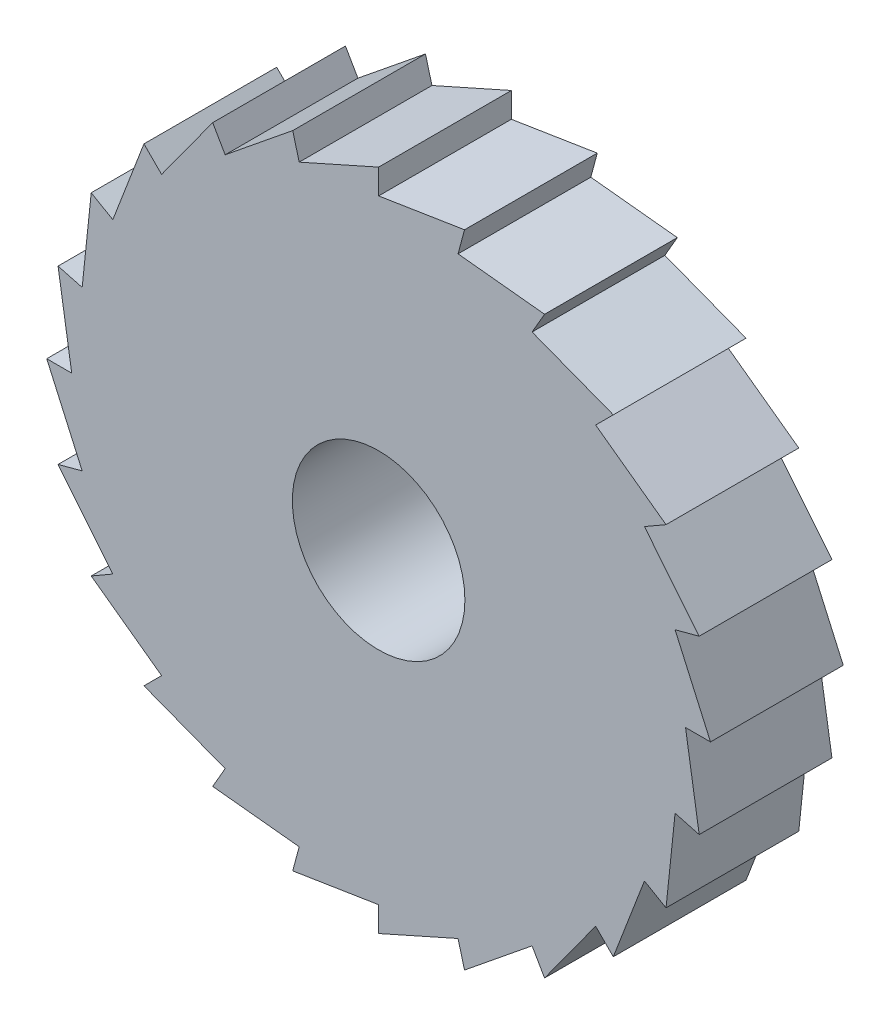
ISO-10303-21;
HEADER;
FILE_DESCRIPTION(('STEP AP214'),'2;1');
FILE_NAME('part.step','',(''),(''),'','','');
FILE_SCHEMA(('AUTOMOTIVE_DESIGN { 1 0 10303 214 1 1 1 1 }'));
ENDSEC;
DATA;
#1=APPLICATION_CONTEXT('core data for automotive mechanical design processes');
#2=APPLICATION_PROTOCOL_DEFINITION('international standard','automotive_design',2000,#1);
#3=PRODUCT_CONTEXT('',#1,'mechanical');
#4=PRODUCT('Part','Part','',(#3));
#5=PRODUCT_RELATED_PRODUCT_CATEGORY('part','',(#4));
#6=PRODUCT_DEFINITION_FORMATION('','',#4);
#7=PRODUCT_DEFINITION_CONTEXT('part definition',#1,'design');
#8=PRODUCT_DEFINITION('design','',#6,#7);
#9=PRODUCT_DEFINITION_SHAPE('','',#8);
#10=(LENGTH_UNIT() NAMED_UNIT(*) SI_UNIT(.MILLI.,.METRE.));
#11=(NAMED_UNIT(*) PLANE_ANGLE_UNIT() SI_UNIT($,.RADIAN.));
#12=(NAMED_UNIT(*) SI_UNIT($,.STERADIAN.) SOLID_ANGLE_UNIT());
#13=UNCERTAINTY_MEASURE_WITH_UNIT(LENGTH_MEASURE(1.E-05),#10,'distance_accuracy_value','');
#14=(GEOMETRIC_REPRESENTATION_CONTEXT(3) GLOBAL_UNCERTAINTY_ASSIGNED_CONTEXT((#13)) GLOBAL_UNIT_ASSIGNED_CONTEXT((#10,
#11,#12)) REPRESENTATION_CONTEXT('',''));
#15=CARTESIAN_POINT('',(0.,0.,0.));
#16=DIRECTION('',(0.,0.,1.));
#17=DIRECTION('',(1.,0.,0.));
#18=AXIS2_PLACEMENT_3D('',#15,#16,#17);
#19=CARTESIAN_POINT('',(-9.29768556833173,20.8548215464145,10.));
#20=DIRECTION('',(-0.40719422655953,0.91334159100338,0.));
#21=DIRECTION('',(-0.91334159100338,-0.40719422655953,0.));
#22=AXIS2_PLACEMENT_3D('',#19,#20,#21);
#23=PLANE('',#22);
#24=DIRECTION('',(0.91334159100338,0.40719422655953,0.));
#25=VECTOR('',#24,1.);
#26=CARTESIAN_POINT('',(-9.29768556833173,20.8548215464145,0.));
#27=LINE('',#26,#25);
#28=CARTESIAN_POINT('',(-5.9838963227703,22.3322051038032,0.));
#29=VERTEX_POINT('',#28);
#30=CARTESIAN_POINT('',(0.,25.,0.));
#31=VERTEX_POINT('',#30);
#32=EDGE_CURVE('E368',#29,#31,#27,.T.);
#33=ORIENTED_EDGE('',*,*,#32,.F.);
#34=DIRECTION('',(0.,0.,-1.));
#35=VECTOR('',#34,1.);
#36=CARTESIAN_POINT('',(-5.9838963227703,22.3322051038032,10.));
#37=LINE('',#36,#35);
#38=CARTESIAN_POINT('',(-5.9838963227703,22.3322051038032,10.));
#39=VERTEX_POINT('',#38);
#40=EDGE_CURVE('E11',#39,#29,#37,.T.);
#41=ORIENTED_EDGE('',*,*,#40,.F.);
#42=DIRECTION('',(0.91334159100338,0.40719422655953,0.));
#43=VECTOR('',#42,1.);
#44=CARTESIAN_POINT('',(-9.29768556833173,20.8548215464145,10.));
#45=LINE('',#44,#43);
#46=CARTESIAN_POINT('',(0.,25.,10.));
#47=VERTEX_POINT('',#46);
#48=EDGE_CURVE('E509',#39,#47,#45,.T.);
#49=ORIENTED_EDGE('',*,*,#48,.T.);
#50=DIRECTION('',(0.,0.,-1.));
#51=VECTOR('',#50,1.);
#52=CARTESIAN_POINT('',(0.,25.,10.));
#53=LINE('',#52,#51);
#54=EDGE_CURVE('E205',#47,#31,#53,.T.);
#55=ORIENTED_EDGE('',*,*,#54,.T.);
#56=EDGE_LOOP('',(#33,#41,#49,#55));
#57=FACE_BOUND('',#56,.T.);
#58=ADVANCED_FACE('F35',(#57),#23,.T.);
#59=CARTESIAN_POINT('',(-2.18667654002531E-13,0.,10.));
#60=DIRECTION('',(-0.965925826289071,-0.258819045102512,0.));
#61=DIRECTION('',(0.258819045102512,-0.965925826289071,0.));
#62=AXIS2_PLACEMENT_3D('',#59,#60,#61);
#63=PLANE('',#62);
#64=DIRECTION('',(-0.258819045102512,0.965925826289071,0.));
#65=VECTOR('',#64,1.);
#66=CARTESIAN_POINT('',(-2.18667654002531E-13,0.,0.));
#67=LINE('',#66,#65);
#68=CARTESIAN_POINT('',(-6.47047612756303,24.1481456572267,0.));
#69=VERTEX_POINT('',#68);
#70=EDGE_CURVE('E371',#29,#69,#67,.T.);
#71=ORIENTED_EDGE('',*,*,#70,.T.);
#72=DIRECTION('',(0.,0.,-1.));
#73=VECTOR('',#72,1.);
#74=CARTESIAN_POINT('',(-6.47047612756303,24.1481456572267,10.));
#75=LINE('',#74,#73);
#76=CARTESIAN_POINT('',(-6.47047612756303,24.1481456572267,10.));
#77=VERTEX_POINT('',#76);
#78=EDGE_CURVE('E43',#77,#69,#75,.T.);
#79=ORIENTED_EDGE('',*,*,#78,.F.);
#80=DIRECTION('',(-0.258819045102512,0.965925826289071,0.));
#81=VECTOR('',#80,1.);
#82=CARTESIAN_POINT('',(-2.18667654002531E-13,0.,10.));
#83=LINE('',#82,#81);
#84=EDGE_CURVE('E620',#39,#77,#83,.T.);
#85=ORIENTED_EDGE('',*,*,#84,.F.);
#86=ORIENTED_EDGE('',*,*,#40,.T.);
#87=EDGE_LOOP('',(#71,#79,#85,#86));
#88=FACE_BOUND('',#87,.T.);
#89=ADVANCED_FACE('F605',(#88),#63,.F.);
#90=CARTESIAN_POINT('',(-14.3784996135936,17.737792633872,10.));
#91=DIRECTION('',(-0.629709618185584,0.776830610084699,0.));
#92=DIRECTION('',(-0.776830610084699,-0.629709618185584,0.));
#93=AXIS2_PLACEMENT_3D('',#90,#91,#92);
#94=PLANE('',#93);
#95=DIRECTION('',(0.776830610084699,0.629709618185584,0.));
#96=VECTOR('',#95,1.);
#97=CARTESIAN_POINT('',(-14.3784996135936,17.737792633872,0.));
#98=LINE('',#97,#96);
#99=CARTESIAN_POINT('',(-11.56,20.0225073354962,0.));
#100=VERTEX_POINT('',#99);
#101=EDGE_CURVE('E375',#100,#69,#98,.T.);
#102=ORIENTED_EDGE('',*,*,#101,.F.);
#103=DIRECTION('',(0.,0.,-1.));
#104=VECTOR('',#103,1.);
#105=CARTESIAN_POINT('',(-11.56,20.0225073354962,10.));
#106=LINE('',#105,#104);
#107=CARTESIAN_POINT('',(-11.56,20.0225073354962,10.));
#108=VERTEX_POINT('',#107);
#109=EDGE_CURVE('E595',#108,#100,#106,.T.);
#110=ORIENTED_EDGE('',*,*,#109,.F.);
#111=DIRECTION('',(0.776830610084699,0.629709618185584,0.));
#112=VECTOR('',#111,1.);
#113=CARTESIAN_POINT('',(-14.3784996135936,17.737792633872,10.));
#114=LINE('',#113,#112);
#115=EDGE_CURVE('E602',#108,#77,#114,.T.);
#116=ORIENTED_EDGE('',*,*,#115,.T.);
#117=ORIENTED_EDGE('',*,*,#78,.T.);
#118=EDGE_LOOP('',(#102,#110,#116,#117));
#119=FACE_BOUND('',#118,.T.);
#120=ADVANCED_FACE('F600',(#119),#94,.T.);
#121=CARTESIAN_POINT('',(-2.34361077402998E-13,-1.35308431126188E-13,10.));
#122=DIRECTION('',(-0.866025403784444,-0.499999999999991,0.));
#123=DIRECTION('',(0.499999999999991,-0.866025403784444,0.));
#124=AXIS2_PLACEMENT_3D('',#121,#122,#123);
#125=PLANE('',#124);
#126=DIRECTION('',(-0.499999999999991,0.866025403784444,0.));
#127=VECTOR('',#126,1.);
#128=CARTESIAN_POINT('',(-2.34361077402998E-13,-1.35308431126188E-13,0.));
#129=LINE('',#128,#127);
#130=CARTESIAN_POINT('',(-12.5,21.650635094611,0.));
#131=VERTEX_POINT('',#130);
#132=EDGE_CURVE('E378',#100,#131,#129,.T.);
#133=ORIENTED_EDGE('',*,*,#132,.T.);
#134=DIRECTION('',(0.,0.,-1.));
#135=VECTOR('',#134,1.);
#136=CARTESIAN_POINT('',(-12.5,21.650635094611,10.));
#137=LINE('',#136,#135);
#138=CARTESIAN_POINT('',(-12.5,21.650635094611,10.));
#139=VERTEX_POINT('',#138);
#140=EDGE_CURVE('E593',#139,#131,#137,.T.);
#141=ORIENTED_EDGE('',*,*,#140,.F.);
#142=DIRECTION('',(-0.499999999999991,0.866025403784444,0.));
#143=VECTOR('',#142,1.);
#144=CARTESIAN_POINT('',(-2.34361077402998E-13,-1.35308431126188E-13,10.));
#145=LINE('',#144,#143);
#146=EDGE_CURVE('E616',#108,#139,#145,.T.);
#147=ORIENTED_EDGE('',*,*,#146,.F.);
#148=ORIENTED_EDGE('',*,*,#109,.T.);
#149=EDGE_LOOP('',(#133,#141,#147,#148));
#150=FACE_BOUND('',#149,.T.);
#151=ADVANCED_FACE('F613',(#150),#125,.F.);
#152=CARTESIAN_POINT('',(-18.4794426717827,13.4119624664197,10.));
#153=DIRECTION('',(-0.809311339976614,0.587379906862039,0.));
#154=DIRECTION('',(-0.587379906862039,-0.809311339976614,0.));
#155=AXIS2_PLACEMENT_3D('',#152,#153,#154);
#156=PLANE('',#155);
#157=DIRECTION('',(0.587379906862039,0.809311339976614,0.));
#158=VECTOR('',#157,1.);
#159=CARTESIAN_POINT('',(-18.4794426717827,13.4119624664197,0.));
#160=LINE('',#159,#158);
#161=CARTESIAN_POINT('',(-16.348308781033,16.348308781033,0.));
#162=VERTEX_POINT('',#161);
#163=EDGE_CURVE('E381',#162,#131,#160,.T.);
#164=ORIENTED_EDGE('',*,*,#163,.F.);
#165=DIRECTION('',(0.,0.,-1.));
#166=VECTOR('',#165,1.);
#167=CARTESIAN_POINT('',(-16.348308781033,16.348308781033,10.));
#168=LINE('',#167,#166);
#169=CARTESIAN_POINT('',(-16.348308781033,16.348308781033,10.));
#170=VERTEX_POINT('',#169);
#171=EDGE_CURVE('E591',#170,#162,#168,.T.);
#172=ORIENTED_EDGE('',*,*,#171,.F.);
#173=DIRECTION('',(0.587379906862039,0.809311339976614,0.));
#174=VECTOR('',#173,1.);
#175=CARTESIAN_POINT('',(-18.4794426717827,13.4119624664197,10.));
#176=LINE('',#175,#174);
#177=EDGE_CURVE('E618',#170,#139,#176,.T.);
#178=ORIENTED_EDGE('',*,*,#177,.T.);
#179=ORIENTED_EDGE('',*,*,#140,.T.);
#180=EDGE_LOOP('',(#164,#172,#178,#179));
#181=FACE_BOUND('',#180,.T.);
#182=ADVANCED_FACE('F762',(#181),#156,.T.);
#183=CARTESIAN_POINT('',(0.,0.,10.));
#184=DIRECTION('',(-0.707106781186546,-0.707106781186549,0.));
#185=DIRECTION('',(0.707106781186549,-0.707106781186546,0.));
#186=AXIS2_PLACEMENT_3D('',#183,#184,#185);
#187=PLANE('',#186);
#188=DIRECTION('',(-0.707106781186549,0.707106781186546,0.));
#189=VECTOR('',#188,1.);
#190=CARTESIAN_POINT('',(0.,0.,0.));
#191=LINE('',#190,#189);
#192=CARTESIAN_POINT('',(-17.6776695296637,17.6776695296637,0.));
#193=VERTEX_POINT('',#192);
#194=EDGE_CURVE('E384',#162,#193,#191,.T.);
#195=ORIENTED_EDGE('',*,*,#194,.T.);
#196=DIRECTION('',(0.,0.,-1.));
#197=VECTOR('',#196,1.);
#198=CARTESIAN_POINT('',(-17.6776695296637,17.6776695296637,10.));
#199=LINE('',#198,#197);
#200=CARTESIAN_POINT('',(-17.6776695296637,17.6776695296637,10.));
#201=VERTEX_POINT('',#200);
#202=EDGE_CURVE('E589',#201,#193,#199,.T.);
#203=ORIENTED_EDGE('',*,*,#202,.F.);
#204=DIRECTION('',(-0.707106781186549,0.707106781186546,0.));
#205=VECTOR('',#204,1.);
#206=CARTESIAN_POINT('',(0.,0.,10.));
#207=LINE('',#206,#205);
#208=EDGE_CURVE('E626',#170,#201,#207,.T.);
#209=ORIENTED_EDGE('',*,*,#208,.F.);
#210=ORIENTED_EDGE('',*,*,#171,.T.);
#211=EDGE_LOOP('',(#195,#203,#209,#210));
#212=FACE_BOUND('',#211,.T.);
#213=ADVANCED_FACE('F765',(#212),#187,.F.);
#214=CARTESIAN_POINT('',(-21.3210422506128,8.17212922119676,10.));
#215=DIRECTION('',(-0.933759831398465,0.357900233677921,0.));
#216=DIRECTION('',(-0.357900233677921,-0.933759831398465,0.));
#217=AXIS2_PLACEMENT_3D('',#214,#215,#216);
#218=PLANE('',#217);
#219=DIRECTION('',(0.357900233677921,0.933759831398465,0.));
#220=VECTOR('',#219,1.);
#221=CARTESIAN_POINT('',(-21.3210422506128,8.17212922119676,0.));
#222=LINE('',#221,#220);
#223=CARTESIAN_POINT('',(-20.0225073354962,11.56,0.));
#224=VERTEX_POINT('',#223);
#225=EDGE_CURVE('E387',#224,#193,#222,.T.);
#226=ORIENTED_EDGE('',*,*,#225,.F.);
#227=DIRECTION('',(0.,0.,-1.));
#228=VECTOR('',#227,1.);
#229=CARTESIAN_POINT('',(-20.0225073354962,11.56,10.));
#230=LINE('',#229,#228);
#231=CARTESIAN_POINT('',(-20.0225073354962,11.56,10.));
#232=VERTEX_POINT('',#231);
#233=EDGE_CURVE('E587',#232,#224,#230,.T.);
#234=ORIENTED_EDGE('',*,*,#233,.F.);
#235=DIRECTION('',(0.357900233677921,0.933759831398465,0.));
#236=VECTOR('',#235,1.);
#237=CARTESIAN_POINT('',(-21.3210422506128,8.17212922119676,10.));
#238=LINE('',#237,#236);
#239=EDGE_CURVE('E628',#232,#201,#238,.T.);
#240=ORIENTED_EDGE('',*,*,#239,.T.);
#241=ORIENTED_EDGE('',*,*,#202,.T.);
#242=EDGE_LOOP('',(#226,#234,#240,#241));
#243=FACE_BOUND('',#242,.T.);
#244=ADVANCED_FACE('F769',(#243),#218,.T.);
#245=CARTESIAN_POINT('',(-1.19695919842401E-13,-2.07319414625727E-13,10.));
#246=DIRECTION('',(-0.500000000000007,-0.866025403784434,0.));
#247=DIRECTION('',(0.866025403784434,-0.500000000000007,0.));
#248=AXIS2_PLACEMENT_3D('',#245,#246,#247);
#249=PLANE('',#248);
#250=DIRECTION('',(-0.866025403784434,0.500000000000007,0.));
#251=VECTOR('',#250,1.);
#252=CARTESIAN_POINT('',(-1.19695919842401E-13,-2.07319414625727E-13,0.));
#253=LINE('',#252,#251);
#254=CARTESIAN_POINT('',(-21.650635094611,12.5,0.));
#255=VERTEX_POINT('',#254);
#256=EDGE_CURVE('E390',#224,#255,#253,.T.);
#257=ORIENTED_EDGE('',*,*,#256,.T.);
#258=DIRECTION('',(0.,0.,-1.));
#259=VECTOR('',#258,1.);
#260=CARTESIAN_POINT('',(-21.650635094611,12.5,10.));
#261=LINE('',#260,#259);
#262=CARTESIAN_POINT('',(-21.650635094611,12.5,10.));
#263=VERTEX_POINT('',#262);
#264=EDGE_CURVE('E585',#263,#255,#261,.T.);
#265=ORIENTED_EDGE('',*,*,#264,.F.);
#266=DIRECTION('',(-0.866025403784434,0.500000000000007,0.));
#267=VECTOR('',#266,1.);
#268=CARTESIAN_POINT('',(-1.19695919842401E-13,-2.07319414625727E-13,10.));
#269=LINE('',#268,#267);
#270=EDGE_CURVE('E631',#232,#263,#269,.T.);
#271=ORIENTED_EDGE('',*,*,#270,.F.);
#272=ORIENTED_EDGE('',*,*,#233,.T.);
#273=EDGE_LOOP('',(#257,#265,#271,#272));
#274=FACE_BOUND('',#273,.T.);
#275=ADVANCED_FACE('F773',(#274),#249,.F.);
#276=CARTESIAN_POINT('',(-22.7096480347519,2.37537887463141,10.));
#277=DIRECTION('',(-0.994574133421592,0.104030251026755,0.));
#278=DIRECTION('',(-0.104030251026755,-0.994574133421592,0.));
#279=AXIS2_PLACEMENT_3D('',#276,#277,#278);
#280=PLANE('',#279);
#281=DIRECTION('',(0.104030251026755,0.994574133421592,0.));
#282=VECTOR('',#281,1.);
#283=CARTESIAN_POINT('',(-22.7096480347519,2.37537887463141,0.));
#284=LINE('',#283,#282);
#285=CARTESIAN_POINT('',(-22.3322051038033,5.98389632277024,0.));
#286=VERTEX_POINT('',#285);
#287=EDGE_CURVE('E393',#286,#255,#284,.T.);
#288=ORIENTED_EDGE('',*,*,#287,.F.);
#289=DIRECTION('',(0.,0.,-1.));
#290=VECTOR('',#289,1.);
#291=CARTESIAN_POINT('',(-22.3322051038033,5.98389632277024,10.));
#292=LINE('',#291,#290);
#293=CARTESIAN_POINT('',(-22.3322051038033,5.98389632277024,10.));
#294=VERTEX_POINT('',#293);
#295=EDGE_CURVE('E583',#294,#286,#292,.T.);
#296=ORIENTED_EDGE('',*,*,#295,.F.);
#297=DIRECTION('',(0.104030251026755,0.994574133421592,0.));
#298=VECTOR('',#297,1.);
#299=CARTESIAN_POINT('',(-22.7096480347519,2.37537887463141,10.));
#300=LINE('',#299,#298);
#301=EDGE_CURVE('E633',#294,#263,#300,.T.);
#302=ORIENTED_EDGE('',*,*,#301,.T.);
#303=ORIENTED_EDGE('',*,*,#264,.T.);
#304=EDGE_LOOP('',(#288,#296,#302,#303));
#305=FACE_BOUND('',#304,.T.);
#306=ADVANCED_FACE('F777',(#305),#280,.T.);
#307=CARTESIAN_POINT('',(0.,-2.42964060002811E-13,10.));
#308=DIRECTION('',(-0.25881904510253,-0.965925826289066,0.));
#309=DIRECTION('',(0.965925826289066,-0.25881904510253,0.));
#310=AXIS2_PLACEMENT_3D('',#307,#308,#309);
#311=PLANE('',#310);
#312=DIRECTION('',(-0.965925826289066,0.25881904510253,0.));
#313=VECTOR('',#312,1.);
#314=CARTESIAN_POINT('',(0.,-2.42964060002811E-13,0.));
#315=LINE('',#314,#313);
#316=CARTESIAN_POINT('',(-24.1481456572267,6.470476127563,0.));
#317=VERTEX_POINT('',#316);
#318=EDGE_CURVE('E396',#286,#317,#315,.T.);
#319=ORIENTED_EDGE('',*,*,#318,.T.);
#320=DIRECTION('',(0.,0.,-1.));
#321=VECTOR('',#320,1.);
#322=CARTESIAN_POINT('',(-24.1481456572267,6.470476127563,10.));
#323=LINE('',#322,#321);
#324=CARTESIAN_POINT('',(-24.1481456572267,6.470476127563,10.));
#325=VERTEX_POINT('',#324);
#326=EDGE_CURVE('E581',#325,#317,#323,.T.);
#327=ORIENTED_EDGE('',*,*,#326,.F.);
#328=DIRECTION('',(-0.965925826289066,0.25881904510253,0.));
#329=VECTOR('',#328,1.);
#330=CARTESIAN_POINT('',(0.,-2.42964060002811E-13,10.));
#331=LINE('',#330,#329);
#332=EDGE_CURVE('E636',#294,#325,#331,.T.);
#333=ORIENTED_EDGE('',*,*,#332,.F.);
#334=ORIENTED_EDGE('',*,*,#295,.T.);
#335=EDGE_LOOP('',(#319,#327,#333,#334));
#336=FACE_BOUND('',#335,.T.);
#337=ADVANCED_FACE('F781',(#336),#311,.F.);
#338=CARTESIAN_POINT('',(-22.5506288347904,-3.58324961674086,10.));
#339=DIRECTION('',(-0.987609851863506,-0.156929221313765,0.));
#340=DIRECTION('',(0.156929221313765,-0.987609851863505,0.));
#341=AXIS2_PLACEMENT_3D('',#338,#339,#340);
#342=PLANE('',#341);
#343=DIRECTION('',(-0.156929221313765,0.987609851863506,0.));
#344=VECTOR('',#343,1.);
#345=CARTESIAN_POINT('',(-22.5506288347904,-3.58324961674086,0.));
#346=LINE('',#345,#344);
#347=CARTESIAN_POINT('',(-23.12,0.,0.));
#348=VERTEX_POINT('',#347);
#349=EDGE_CURVE('E399',#348,#317,#346,.T.);
#350=ORIENTED_EDGE('',*,*,#349,.F.);
#351=DIRECTION('',(0.,0.,-1.));
#352=VECTOR('',#351,1.);
#353=CARTESIAN_POINT('',(-23.12,0.,10.));
#354=LINE('',#353,#352);
#355=CARTESIAN_POINT('',(-23.12,0.,10.));
#356=VERTEX_POINT('',#355);
#357=EDGE_CURVE('E579',#356,#348,#354,.T.);
#358=ORIENTED_EDGE('',*,*,#357,.F.);
#359=DIRECTION('',(-0.156929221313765,0.987609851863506,0.));
#360=VECTOR('',#359,1.);
#361=CARTESIAN_POINT('',(-22.5506288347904,-3.58324961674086,10.));
#362=LINE('',#361,#360);
#363=EDGE_CURVE('E638',#356,#325,#362,.T.);
#364=ORIENTED_EDGE('',*,*,#363,.T.);
#365=ORIENTED_EDGE('',*,*,#326,.T.);
#366=EDGE_LOOP('',(#350,#358,#364,#365));
#367=FACE_BOUND('',#366,.T.);
#368=ADVANCED_FACE('F785',(#367),#342,.T.);
#369=CARTESIAN_POINT('',(0.,0.,10.));
#370=DIRECTION('',(0.,-1.,0.));
#371=DIRECTION('',(1.,0.,0.));
#372=AXIS2_PLACEMENT_3D('',#369,#370,#371);
#373=PLANE('',#372);
#374=DIRECTION('',(-1.,0.,0.));
#375=VECTOR('',#374,1.);
#376=CARTESIAN_POINT('',(0.,0.,0.));
#377=LINE('',#376,#375);
#378=CARTESIAN_POINT('',(-25.,0.,0.));
#379=VERTEX_POINT('',#378);
#380=EDGE_CURVE('E402',#348,#379,#377,.T.);
#381=ORIENTED_EDGE('',*,*,#380,.T.);
#382=DIRECTION('',(0.,0.,-1.));
#383=VECTOR('',#382,1.);
#384=CARTESIAN_POINT('',(-25.,0.,10.));
#385=LINE('',#384,#383);
#386=CARTESIAN_POINT('',(-25.,0.,10.));
#387=VERTEX_POINT('',#386);
#388=EDGE_CURVE('E577',#387,#379,#385,.T.);
#389=ORIENTED_EDGE('',*,*,#388,.F.);
#390=DIRECTION('',(-1.,0.,0.));
#391=VECTOR('',#390,1.);
#392=CARTESIAN_POINT('',(0.,0.,10.));
#393=LINE('',#392,#391);
#394=EDGE_CURVE('E641',#356,#387,#393,.T.);
#395=ORIENTED_EDGE('',*,*,#394,.F.);
#396=ORIENTED_EDGE('',*,*,#357,.T.);
#397=EDGE_LOOP('',(#381,#389,#395,#396));
#398=FACE_BOUND('',#397,.T.);
#399=ADVANCED_FACE('F789',(#398),#373,.F.);
#400=CARTESIAN_POINT('',(-20.8548215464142,-9.29768556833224,10.));
#401=DIRECTION('',(-0.91334159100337,-0.407194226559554,0.));
#402=DIRECTION('',(0.407194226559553,-0.91334159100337,0.));
#403=AXIS2_PLACEMENT_3D('',#400,#401,#402);
#404=PLANE('',#403);
#405=DIRECTION('',(-0.407194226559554,0.91334159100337,0.));
#406=VECTOR('',#405,1.);
#407=CARTESIAN_POINT('',(-20.8548215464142,-9.29768556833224,0.));
#408=LINE('',#407,#406);
#409=CARTESIAN_POINT('',(-22.3322051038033,-5.98389632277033,0.));
#410=VERTEX_POINT('',#409);
#411=EDGE_CURVE('E405',#410,#379,#408,.T.);
#412=ORIENTED_EDGE('',*,*,#411,.F.);
#413=DIRECTION('',(0.,0.,-1.));
#414=VECTOR('',#413,1.);
#415=CARTESIAN_POINT('',(-22.3322051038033,-5.98389632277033,10.));
#416=LINE('',#415,#414);
#417=CARTESIAN_POINT('',(-22.3322051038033,-5.98389632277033,10.));
#418=VERTEX_POINT('',#417);
#419=EDGE_CURVE('E575',#418,#410,#416,.T.);
#420=ORIENTED_EDGE('',*,*,#419,.F.);
#421=DIRECTION('',(-0.407194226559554,0.91334159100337,0.));
#422=VECTOR('',#421,1.);
#423=CARTESIAN_POINT('',(-20.8548215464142,-9.29768556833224,10.));
#424=LINE('',#423,#422);
#425=EDGE_CURVE('E643',#418,#387,#424,.T.);
#426=ORIENTED_EDGE('',*,*,#425,.T.);
#427=ORIENTED_EDGE('',*,*,#388,.T.);
#428=EDGE_LOOP('',(#412,#420,#426,#427));
#429=FACE_BOUND('',#428,.T.);
#430=ADVANCED_FACE('F793',(#429),#404,.T.);
#431=CARTESIAN_POINT('',(0.,-2.30396953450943E-13,10.));
#432=DIRECTION('',(0.258819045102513,-0.96592582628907,0.));
#433=DIRECTION('',(0.96592582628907,0.258819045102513,0.));
#434=AXIS2_PLACEMENT_3D('',#431,#432,#433);
#435=PLANE('',#434);
#436=DIRECTION('',(-0.96592582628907,-0.258819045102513,0.));
#437=VECTOR('',#436,1.);
#438=CARTESIAN_POINT('',(0.,-2.30396953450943E-13,0.));
#439=LINE('',#438,#437);
#440=CARTESIAN_POINT('',(-24.1481456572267,-6.47047612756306,0.));
#441=VERTEX_POINT('',#440);
#442=EDGE_CURVE('E408',#410,#441,#439,.T.);
#443=ORIENTED_EDGE('',*,*,#442,.T.);
#444=DIRECTION('',(0.,0.,-1.));
#445=VECTOR('',#444,1.);
#446=CARTESIAN_POINT('',(-24.1481456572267,-6.47047612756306,10.));
#447=LINE('',#446,#445);
#448=CARTESIAN_POINT('',(-24.1481456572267,-6.47047612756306,10.));
#449=VERTEX_POINT('',#448);
#450=EDGE_CURVE('E573',#449,#441,#447,.T.);
#451=ORIENTED_EDGE('',*,*,#450,.F.);
#452=DIRECTION('',(-0.96592582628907,-0.258819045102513,0.));
#453=VECTOR('',#452,1.);
#454=CARTESIAN_POINT('',(0.,-2.30396953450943E-13,10.));
#455=LINE('',#454,#453);
#456=EDGE_CURVE('E646',#418,#449,#455,.T.);
#457=ORIENTED_EDGE('',*,*,#456,.F.);
#458=ORIENTED_EDGE('',*,*,#419,.T.);
#459=EDGE_LOOP('',(#443,#451,#457,#458));
#460=FACE_BOUND('',#459,.T.);
#461=ADVANCED_FACE('F797',(#460),#435,.F.);
#462=CARTESIAN_POINT('',(-17.737792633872,-14.3784996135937,10.));
#463=DIRECTION('',(-0.776830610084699,-0.629709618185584,0.));
#464=DIRECTION('',(0.629709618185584,-0.776830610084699,0.));
#465=AXIS2_PLACEMENT_3D('',#462,#463,#464);
#466=PLANE('',#465);
#467=DIRECTION('',(-0.629709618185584,0.776830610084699,0.));
#468=VECTOR('',#467,1.);
#469=CARTESIAN_POINT('',(-17.737792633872,-14.3784996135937,0.));
#470=LINE('',#469,#468);
#471=CARTESIAN_POINT('',(-20.0225073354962,-11.5600000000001,0.));
#472=VERTEX_POINT('',#471);
#473=EDGE_CURVE('E411',#472,#441,#470,.T.);
#474=ORIENTED_EDGE('',*,*,#473,.F.);
#475=DIRECTION('',(0.,0.,-1.));
#476=VECTOR('',#475,1.);
#477=CARTESIAN_POINT('',(-20.0225073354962,-11.5600000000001,10.));
#478=LINE('',#477,#476);
#479=CARTESIAN_POINT('',(-20.0225073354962,-11.5600000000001,10.));
#480=VERTEX_POINT('',#479);
#481=EDGE_CURVE('E571',#480,#472,#478,.T.);
#482=ORIENTED_EDGE('',*,*,#481,.F.);
#483=DIRECTION('',(-0.629709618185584,0.776830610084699,0.));
#484=VECTOR('',#483,1.);
#485=CARTESIAN_POINT('',(-17.737792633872,-14.3784996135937,10.));
#486=LINE('',#485,#484);
#487=EDGE_CURVE('E648',#480,#449,#486,.T.);
#488=ORIENTED_EDGE('',*,*,#487,.T.);
#489=ORIENTED_EDGE('',*,*,#450,.T.);
#490=EDGE_LOOP('',(#474,#482,#488,#489));
#491=FACE_BOUND('',#490,.T.);
#492=ADVANCED_FACE('F801',(#491),#466,.T.);
#493=CARTESIAN_POINT('',(0.,-1.12673594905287E-13,10.));
#494=DIRECTION('',(0.499999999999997,-0.866025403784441,0.));
#495=DIRECTION('',(0.866025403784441,0.499999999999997,0.));
#496=AXIS2_PLACEMENT_3D('',#493,#494,#495);
#497=PLANE('',#496);
#498=DIRECTION('',(-0.866025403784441,-0.499999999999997,0.));
#499=VECTOR('',#498,1.);
#500=CARTESIAN_POINT('',(0.,-1.12673594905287E-13,0.));
#501=LINE('',#500,#499);
#502=CARTESIAN_POINT('',(-21.650635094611,-12.5,0.));
#503=VERTEX_POINT('',#502);
#504=EDGE_CURVE('E414',#472,#503,#501,.T.);
#505=ORIENTED_EDGE('',*,*,#504,.T.);
#506=DIRECTION('',(0.,0.,-1.));
#507=VECTOR('',#506,1.);
#508=CARTESIAN_POINT('',(-21.650635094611,-12.5,10.));
#509=LINE('',#508,#507);
#510=CARTESIAN_POINT('',(-21.650635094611,-12.5,10.));
#511=VERTEX_POINT('',#510);
#512=EDGE_CURVE('E569',#511,#503,#509,.T.);
#513=ORIENTED_EDGE('',*,*,#512,.F.);
#514=DIRECTION('',(-0.866025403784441,-0.499999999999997,0.));
#515=VECTOR('',#514,1.);
#516=CARTESIAN_POINT('',(0.,-1.12673594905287E-13,10.));
#517=LINE('',#516,#515);
#518=EDGE_CURVE('E651',#480,#511,#517,.T.);
#519=ORIENTED_EDGE('',*,*,#518,.F.);
#520=ORIENTED_EDGE('',*,*,#481,.T.);
#521=EDGE_LOOP('',(#505,#513,#519,#520));
#522=FACE_BOUND('',#521,.T.);
#523=ADVANCED_FACE('F805',(#522),#497,.F.);
#524=CARTESIAN_POINT('',(-13.4119624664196,-18.4794426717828,10.));
#525=DIRECTION('',(-0.587379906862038,-0.809311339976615,0.));
#526=DIRECTION('',(0.809311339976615,-0.587379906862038,0.));
#527=AXIS2_PLACEMENT_3D('',#524,#525,#526);
#528=PLANE('',#527);
#529=DIRECTION('',(-0.809311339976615,0.587379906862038,0.));
#530=VECTOR('',#529,1.);
#531=CARTESIAN_POINT('',(-13.4119624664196,-18.4794426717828,0.));
#532=LINE('',#531,#530);
#533=CARTESIAN_POINT('',(-16.348308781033,-16.348308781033,0.));
#534=VERTEX_POINT('',#533);
#535=EDGE_CURVE('E417',#534,#503,#532,.T.);
#536=ORIENTED_EDGE('',*,*,#535,.F.);
#537=DIRECTION('',(0.,0.,-1.));
#538=VECTOR('',#537,1.);
#539=CARTESIAN_POINT('',(-16.348308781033,-16.348308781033,10.));
#540=LINE('',#539,#538);
#541=CARTESIAN_POINT('',(-16.348308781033,-16.348308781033,10.));
#542=VERTEX_POINT('',#541);
#543=EDGE_CURVE('E567',#542,#534,#540,.T.);
#544=ORIENTED_EDGE('',*,*,#543,.F.);
#545=DIRECTION('',(-0.809311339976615,0.587379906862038,0.));
#546=VECTOR('',#545,1.);
#547=CARTESIAN_POINT('',(-13.4119624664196,-18.4794426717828,10.));
#548=LINE('',#547,#546);
#549=EDGE_CURVE('E653',#542,#511,#548,.T.);
#550=ORIENTED_EDGE('',*,*,#549,.T.);
#551=ORIENTED_EDGE('',*,*,#512,.T.);
#552=EDGE_LOOP('',(#536,#544,#550,#551));
#553=FACE_BOUND('',#552,.T.);
#554=ADVANCED_FACE('F809',(#553),#528,.T.);
#555=CARTESIAN_POINT('',(1.5578261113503E-13,-1.55782611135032E-13,10.));
#556=DIRECTION('',(0.707106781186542,-0.707106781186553,0.));
#557=DIRECTION('',(0.707106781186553,0.707106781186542,0.));
#558=AXIS2_PLACEMENT_3D('',#555,#556,#557);
#559=PLANE('',#558);
#560=DIRECTION('',(-0.707106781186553,-0.707106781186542,0.));
#561=VECTOR('',#560,1.);
#562=CARTESIAN_POINT('',(1.5578261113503E-13,-1.55782611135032E-13,0.));
#563=LINE('',#562,#561);
#564=CARTESIAN_POINT('',(-17.6776695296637,-17.6776695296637,0.));
#565=VERTEX_POINT('',#564);
#566=EDGE_CURVE('E420',#534,#565,#563,.T.);
#567=ORIENTED_EDGE('',*,*,#566,.T.);
#568=DIRECTION('',(0.,0.,-1.));
#569=VECTOR('',#568,1.);
#570=CARTESIAN_POINT('',(-17.6776695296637,-17.6776695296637,10.));
#571=LINE('',#570,#569);
#572=CARTESIAN_POINT('',(-17.6776695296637,-17.6776695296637,10.));
#573=VERTEX_POINT('',#572);
#574=EDGE_CURVE('E565',#573,#565,#571,.T.);
#575=ORIENTED_EDGE('',*,*,#574,.F.);
#576=DIRECTION('',(-0.707106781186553,-0.707106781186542,0.));
#577=VECTOR('',#576,1.);
#578=CARTESIAN_POINT('',(1.5578261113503E-13,-1.55782611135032E-13,10.));
#579=LINE('',#578,#577);
#580=EDGE_CURVE('E656',#542,#573,#579,.T.);
#581=ORIENTED_EDGE('',*,*,#580,.F.);
#582=ORIENTED_EDGE('',*,*,#543,.T.);
#583=EDGE_LOOP('',(#567,#575,#581,#582));
#584=FACE_BOUND('',#583,.T.);
#585=ADVANCED_FACE('F813',(#584),#559,.F.);
#586=CARTESIAN_POINT('',(-8.17212922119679,-21.3210422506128,10.));
#587=DIRECTION('',(-0.357900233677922,-0.933759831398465,0.));
#588=DIRECTION('',(0.933759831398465,-0.357900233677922,0.));
#589=AXIS2_PLACEMENT_3D('',#586,#587,#588);
#590=PLANE('',#589);
#591=DIRECTION('',(-0.933759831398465,0.357900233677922,0.));
#592=VECTOR('',#591,1.);
#593=CARTESIAN_POINT('',(-8.17212922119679,-21.3210422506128,0.));
#594=LINE('',#593,#592);
#595=CARTESIAN_POINT('',(-11.56,-20.0225073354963,0.));
#596=VERTEX_POINT('',#595);
#597=EDGE_CURVE('E423',#596,#565,#594,.T.);
#598=ORIENTED_EDGE('',*,*,#597,.F.);
#599=DIRECTION('',(0.,0.,-1.));
#600=VECTOR('',#599,1.);
#601=CARTESIAN_POINT('',(-11.56,-20.0225073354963,10.));
#602=LINE('',#601,#600);
#603=CARTESIAN_POINT('',(-11.56,-20.0225073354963,10.));
#604=VERTEX_POINT('',#603);
#605=EDGE_CURVE('E563',#604,#596,#602,.T.);
#606=ORIENTED_EDGE('',*,*,#605,.F.);
#607=DIRECTION('',(-0.933759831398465,0.357900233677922,0.));
#608=VECTOR('',#607,1.);
#609=CARTESIAN_POINT('',(-8.17212922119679,-21.3210422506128,10.));
#610=LINE('',#609,#608);
#611=EDGE_CURVE('E658',#604,#573,#610,.T.);
#612=ORIENTED_EDGE('',*,*,#611,.T.);
#613=ORIENTED_EDGE('',*,*,#574,.T.);
#614=EDGE_LOOP('',(#598,#606,#612,#613));
#615=FACE_BOUND('',#614,.T.);
#616=ADVANCED_FACE('F817',(#615),#590,.T.);
#617=CARTESIAN_POINT('',(1.12673594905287E-13,0.,10.));
#618=DIRECTION('',(0.866025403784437,-0.500000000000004,0.));
#619=DIRECTION('',(0.500000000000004,0.866025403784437,0.));
#620=AXIS2_PLACEMENT_3D('',#617,#618,#619);
#621=PLANE('',#620);
#622=DIRECTION('',(-0.500000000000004,-0.866025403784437,0.));
#623=VECTOR('',#622,1.);
#624=CARTESIAN_POINT('',(1.12673594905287E-13,0.,0.));
#625=LINE('',#624,#623);
#626=CARTESIAN_POINT('',(-12.5,-21.650635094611,0.));
#627=VERTEX_POINT('',#626);
#628=EDGE_CURVE('E426',#596,#627,#625,.T.);
#629=ORIENTED_EDGE('',*,*,#628,.T.);
#630=DIRECTION('',(0.,0.,-1.));
#631=VECTOR('',#630,1.);
#632=CARTESIAN_POINT('',(-12.5,-21.650635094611,10.));
#633=LINE('',#632,#631);
#634=CARTESIAN_POINT('',(-12.5,-21.650635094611,10.));
#635=VERTEX_POINT('',#634);
#636=EDGE_CURVE('E561',#635,#627,#633,.T.);
#637=ORIENTED_EDGE('',*,*,#636,.F.);
#638=DIRECTION('',(-0.500000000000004,-0.866025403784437,0.));
#639=VECTOR('',#638,1.);
#640=CARTESIAN_POINT('',(1.12673594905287E-13,0.,10.));
#641=LINE('',#640,#639);
#642=EDGE_CURVE('E661',#604,#635,#641,.T.);
#643=ORIENTED_EDGE('',*,*,#642,.F.);
#644=ORIENTED_EDGE('',*,*,#605,.T.);
#645=EDGE_LOOP('',(#629,#637,#643,#644));
#646=FACE_BOUND('',#645,.T.);
#647=ADVANCED_FACE('F821',(#646),#621,.F.);
#648=CARTESIAN_POINT('',(-2.37537887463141,-22.7096480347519,10.));
#649=DIRECTION('',(-0.104030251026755,-0.994574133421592,0.));
#650=DIRECTION('',(0.994574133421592,-0.104030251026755,0.));
#651=AXIS2_PLACEMENT_3D('',#648,#649,#650);
#652=PLANE('',#651);
#653=DIRECTION('',(-0.994574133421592,0.104030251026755,0.));
#654=VECTOR('',#653,1.);
#655=CARTESIAN_POINT('',(-2.37537887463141,-22.7096480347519,0.));
#656=LINE('',#655,#654);
#657=CARTESIAN_POINT('',(-5.98389632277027,-22.3322051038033,0.));
#658=VERTEX_POINT('',#657);
#659=EDGE_CURVE('E429',#658,#627,#656,.T.);
#660=ORIENTED_EDGE('',*,*,#659,.F.);
#661=DIRECTION('',(0.,0.,-1.));
#662=VECTOR('',#661,1.);
#663=CARTESIAN_POINT('',(-5.98389632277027,-22.3322051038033,10.));
#664=LINE('',#663,#662);
#665=CARTESIAN_POINT('',(-5.98389632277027,-22.3322051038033,10.));
#666=VERTEX_POINT('',#665);
#667=EDGE_CURVE('E559',#666,#658,#664,.T.);
#668=ORIENTED_EDGE('',*,*,#667,.F.);
#669=DIRECTION('',(-0.994574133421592,0.104030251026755,0.));
#670=VECTOR('',#669,1.);
#671=CARTESIAN_POINT('',(-2.37537887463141,-22.7096480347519,10.));
#672=LINE('',#671,#670);
#673=EDGE_CURVE('E663',#666,#635,#672,.T.);
#674=ORIENTED_EDGE('',*,*,#673,.T.);
#675=ORIENTED_EDGE('',*,*,#636,.T.);
#676=EDGE_LOOP('',(#660,#668,#674,#675));
#677=FACE_BOUND('',#676,.T.);
#678=ADVANCED_FACE('F825',(#677),#652,.T.);
#679=CARTESIAN_POINT('',(2.30396953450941E-13,0.,10.));
#680=DIRECTION('',(0.965925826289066,-0.25881904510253,0.));
#681=DIRECTION('',(0.25881904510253,0.965925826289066,0.));
#682=AXIS2_PLACEMENT_3D('',#679,#680,#681);
#683=PLANE('',#682);
#684=DIRECTION('',(-0.25881904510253,-0.965925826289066,0.));
#685=VECTOR('',#684,1.);
#686=CARTESIAN_POINT('',(2.30396953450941E-13,0.,0.));
#687=LINE('',#686,#685);
#688=CARTESIAN_POINT('',(-6.47047612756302,-24.1481456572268,0.));
#689=VERTEX_POINT('',#688);
#690=EDGE_CURVE('E432',#658,#689,#687,.T.);
#691=ORIENTED_EDGE('',*,*,#690,.T.);
#692=DIRECTION('',(0.,0.,-1.));
#693=VECTOR('',#692,1.);
#694=CARTESIAN_POINT('',(-6.47047612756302,-24.1481456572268,10.));
#695=LINE('',#694,#693);
#696=CARTESIAN_POINT('',(-6.47047612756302,-24.1481456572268,10.));
#697=VERTEX_POINT('',#696);
#698=EDGE_CURVE('E557',#697,#689,#695,.T.);
#699=ORIENTED_EDGE('',*,*,#698,.F.);
#700=DIRECTION('',(-0.25881904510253,-0.965925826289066,0.));
#701=VECTOR('',#700,1.);
#702=CARTESIAN_POINT('',(2.30396953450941E-13,0.,10.));
#703=LINE('',#702,#701);
#704=EDGE_CURVE('E666',#666,#697,#703,.T.);
#705=ORIENTED_EDGE('',*,*,#704,.F.);
#706=ORIENTED_EDGE('',*,*,#667,.T.);
#707=EDGE_LOOP('',(#691,#699,#705,#706));
#708=FACE_BOUND('',#707,.T.);
#709=ADVANCED_FACE('F829',(#708),#683,.F.);
#710=CARTESIAN_POINT('',(3.58324961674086,-22.5506288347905,10.));
#711=DIRECTION('',(0.156929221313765,-0.987609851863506,0.));
#712=DIRECTION('',(0.987609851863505,0.156929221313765,0.));
#713=AXIS2_PLACEMENT_3D('',#710,#711,#712);
#714=PLANE('',#713);
#715=DIRECTION('',(-0.987609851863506,-0.156929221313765,0.));
#716=VECTOR('',#715,1.);
#717=CARTESIAN_POINT('',(3.58324961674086,-22.5506288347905,0.));
#718=LINE('',#717,#716);
#719=CARTESIAN_POINT('',(0.,-23.1200000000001,0.));
#720=VERTEX_POINT('',#719);
#721=EDGE_CURVE('E435',#720,#689,#718,.T.);
#722=ORIENTED_EDGE('',*,*,#721,.F.);
#723=DIRECTION('',(0.,0.,-1.));
#724=VECTOR('',#723,1.);
#725=CARTESIAN_POINT('',(0.,-23.1200000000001,10.));
#726=LINE('',#725,#724);
#727=CARTESIAN_POINT('',(0.,-23.1200000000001,10.));
#728=VERTEX_POINT('',#727);
#729=EDGE_CURVE('E555',#728,#720,#726,.T.);
#730=ORIENTED_EDGE('',*,*,#729,.F.);
#731=DIRECTION('',(-0.987609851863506,-0.156929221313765,0.));
#732=VECTOR('',#731,1.);
#733=CARTESIAN_POINT('',(3.58324961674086,-22.5506288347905,10.));
#734=LINE('',#733,#732);
#735=EDGE_CURVE('E668',#728,#697,#734,.T.);
#736=ORIENTED_EDGE('',*,*,#735,.T.);
#737=ORIENTED_EDGE('',*,*,#698,.T.);
#738=EDGE_LOOP('',(#722,#730,#736,#737));
#739=FACE_BOUND('',#738,.T.);
#740=ADVANCED_FACE('F833',(#739),#714,.T.);
#741=CARTESIAN_POINT('',(1.00940026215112E-13,0.,10.));
#742=DIRECTION('',(1.,0.,0.));
#743=DIRECTION('',(0.,1.,0.));
#744=AXIS2_PLACEMENT_3D('',#741,#742,#743);
#745=PLANE('',#744);
#746=DIRECTION('',(0.,-1.,0.));
#747=VECTOR('',#746,1.);
#748=CARTESIAN_POINT('',(1.00940026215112E-13,0.,0.));
#749=LINE('',#748,#747);
#750=CARTESIAN_POINT('',(0.,-25.,0.));
#751=VERTEX_POINT('',#750);
#752=EDGE_CURVE('E438',#720,#751,#749,.T.);
#753=ORIENTED_EDGE('',*,*,#752,.T.);
#754=DIRECTION('',(0.,0.,-1.));
#755=VECTOR('',#754,1.);
#756=CARTESIAN_POINT('',(0.,-25.,10.));
#757=LINE('',#756,#755);
#758=CARTESIAN_POINT('',(0.,-25.,10.));
#759=VERTEX_POINT('',#758);
#760=EDGE_CURVE('E553',#759,#751,#757,.T.);
#761=ORIENTED_EDGE('',*,*,#760,.F.);
#762=DIRECTION('',(0.,-1.,0.));
#763=VECTOR('',#762,1.);
#764=CARTESIAN_POINT('',(1.00940026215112E-13,0.,10.));
#765=LINE('',#764,#763);
#766=EDGE_CURVE('E671',#728,#759,#765,.T.);
#767=ORIENTED_EDGE('',*,*,#766,.F.);
#768=ORIENTED_EDGE('',*,*,#729,.T.);
#769=EDGE_LOOP('',(#753,#761,#767,#768));
#770=FACE_BOUND('',#769,.T.);
#771=ADVANCED_FACE('F837',(#770),#745,.F.);
#772=CARTESIAN_POINT('',(9.29768556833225,-20.8548215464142,10.));
#773=DIRECTION('',(0.407194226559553,-0.91334159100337,0.));
#774=DIRECTION('',(0.91334159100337,0.407194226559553,0.));
#775=AXIS2_PLACEMENT_3D('',#772,#773,#774);
#776=PLANE('',#775);
#777=DIRECTION('',(-0.91334159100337,-0.407194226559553,0.));
#778=VECTOR('',#777,1.);
#779=CARTESIAN_POINT('',(9.29768556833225,-20.8548215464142,0.));
#780=LINE('',#779,#778);
#781=CARTESIAN_POINT('',(5.9838963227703,-22.3322051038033,0.));
#782=VERTEX_POINT('',#781);
#783=EDGE_CURVE('E441',#782,#751,#780,.T.);
#784=ORIENTED_EDGE('',*,*,#783,.F.);
#785=DIRECTION('',(0.,0.,-1.));
#786=VECTOR('',#785,1.);
#787=CARTESIAN_POINT('',(5.9838963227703,-22.3322051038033,10.));
#788=LINE('',#787,#786);
#789=CARTESIAN_POINT('',(5.9838963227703,-22.3322051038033,10.));
#790=VERTEX_POINT('',#789);
#791=EDGE_CURVE('E551',#790,#782,#788,.T.);
#792=ORIENTED_EDGE('',*,*,#791,.F.);
#793=DIRECTION('',(-0.91334159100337,-0.407194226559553,0.));
#794=VECTOR('',#793,1.);
#795=CARTESIAN_POINT('',(9.29768556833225,-20.8548215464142,10.));
#796=LINE('',#795,#794);
#797=EDGE_CURVE('E673',#790,#759,#796,.T.);
#798=ORIENTED_EDGE('',*,*,#797,.T.);
#799=ORIENTED_EDGE('',*,*,#760,.T.);
#800=EDGE_LOOP('',(#784,#792,#798,#799));
#801=FACE_BOUND('',#800,.T.);
#802=ADVANCED_FACE('F841',(#801),#776,.T.);
#803=CARTESIAN_POINT('',(0.,0.,10.));
#804=DIRECTION('',(0.965925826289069,0.258819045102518,0.));
#805=DIRECTION('',(-0.258819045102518,0.965925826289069,0.));
#806=AXIS2_PLACEMENT_3D('',#803,#804,#805);
#807=PLANE('',#806);
#808=DIRECTION('',(0.258819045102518,-0.965925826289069,0.));
#809=VECTOR('',#808,1.);
#810=CARTESIAN_POINT('',(0.,0.,0.));
#811=LINE('',#810,#809);
#812=CARTESIAN_POINT('',(6.47047612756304,-24.1481456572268,0.));
#813=VERTEX_POINT('',#812);
#814=EDGE_CURVE('E444',#782,#813,#811,.T.);
#815=ORIENTED_EDGE('',*,*,#814,.T.);
#816=DIRECTION('',(0.,0.,-1.));
#817=VECTOR('',#816,1.);
#818=CARTESIAN_POINT('',(6.47047612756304,-24.1481456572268,10.));
#819=LINE('',#818,#817);
#820=CARTESIAN_POINT('',(6.47047612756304,-24.1481456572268,10.));
#821=VERTEX_POINT('',#820);
#822=EDGE_CURVE('E549',#821,#813,#819,.T.);
#823=ORIENTED_EDGE('',*,*,#822,.F.);
#824=DIRECTION('',(0.258819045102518,-0.965925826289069,0.));
#825=VECTOR('',#824,1.);
#826=CARTESIAN_POINT('',(0.,0.,10.));
#827=LINE('',#826,#825);
#828=EDGE_CURVE('E676',#790,#821,#827,.T.);
#829=ORIENTED_EDGE('',*,*,#828,.F.);
#830=ORIENTED_EDGE('',*,*,#791,.T.);
#831=EDGE_LOOP('',(#815,#823,#829,#830));
#832=FACE_BOUND('',#831,.T.);
#833=ADVANCED_FACE('F845',(#832),#807,.F.);
#834=CARTESIAN_POINT('',(14.3784996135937,-17.737792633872,10.));
#835=DIRECTION('',(0.629709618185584,-0.776830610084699,0.));
#836=DIRECTION('',(0.776830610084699,0.629709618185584,0.));
#837=AXIS2_PLACEMENT_3D('',#834,#835,#836);
#838=PLANE('',#837);
#839=DIRECTION('',(-0.776830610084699,-0.629709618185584,0.));
#840=VECTOR('',#839,1.);
#841=CARTESIAN_POINT('',(14.3784996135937,-17.737792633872,0.));
#842=LINE('',#841,#840);
#843=CARTESIAN_POINT('',(11.56,-20.0225073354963,0.));
#844=VERTEX_POINT('',#843);
#845=EDGE_CURVE('E447',#844,#813,#842,.T.);
#846=ORIENTED_EDGE('',*,*,#845,.F.);
#847=DIRECTION('',(0.,0.,-1.));
#848=VECTOR('',#847,1.);
#849=CARTESIAN_POINT('',(11.56,-20.0225073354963,10.));
#850=LINE('',#849,#848);
#851=CARTESIAN_POINT('',(11.56,-20.0225073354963,10.));
#852=VERTEX_POINT('',#851);
#853=EDGE_CURVE('E547',#852,#844,#850,.T.);
#854=ORIENTED_EDGE('',*,*,#853,.F.);
#855=DIRECTION('',(-0.776830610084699,-0.629709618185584,0.));
#856=VECTOR('',#855,1.);
#857=CARTESIAN_POINT('',(14.3784996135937,-17.737792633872,10.));
#858=LINE('',#857,#856);
#859=EDGE_CURVE('E678',#852,#821,#858,.T.);
#860=ORIENTED_EDGE('',*,*,#859,.T.);
#861=ORIENTED_EDGE('',*,*,#822,.T.);
#862=EDGE_LOOP('',(#846,#854,#860,#861));
#863=FACE_BOUND('',#862,.T.);
#864=ADVANCED_FACE('F849',(#863),#838,.T.);
#865=CARTESIAN_POINT('',(1.84784695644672E-13,1.06685493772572E-13,10.));
#866=DIRECTION('',(0.866025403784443,0.499999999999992,0.));
#867=DIRECTION('',(-0.499999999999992,0.866025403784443,0.));
#868=AXIS2_PLACEMENT_3D('',#865,#866,#867);
#869=PLANE('',#868);
#870=DIRECTION('',(0.499999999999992,-0.866025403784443,0.));
#871=VECTOR('',#870,1.);
#872=CARTESIAN_POINT('',(1.84784695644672E-13,1.06685493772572E-13,0.));
#873=LINE('',#872,#871);
#874=CARTESIAN_POINT('',(12.5,-21.650635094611,0.));
#875=VERTEX_POINT('',#874);
#876=EDGE_CURVE('E450',#844,#875,#873,.T.);
#877=ORIENTED_EDGE('',*,*,#876,.T.);
#878=DIRECTION('',(0.,0.,-1.));
#879=VECTOR('',#878,1.);
#880=CARTESIAN_POINT('',(12.5,-21.650635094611,10.));
#881=LINE('',#880,#879);
#882=CARTESIAN_POINT('',(12.5,-21.650635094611,10.));
#883=VERTEX_POINT('',#882);
#884=EDGE_CURVE('E545',#883,#875,#881,.T.);
#885=ORIENTED_EDGE('',*,*,#884,.F.);
#886=DIRECTION('',(0.499999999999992,-0.866025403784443,0.));
#887=VECTOR('',#886,1.);
#888=CARTESIAN_POINT('',(1.84784695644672E-13,1.06685493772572E-13,10.));
#889=LINE('',#888,#887);
#890=EDGE_CURVE('E681',#852,#883,#889,.T.);
#891=ORIENTED_EDGE('',*,*,#890,.F.);
#892=ORIENTED_EDGE('',*,*,#853,.T.);
#893=EDGE_LOOP('',(#877,#885,#891,#892));
#894=FACE_BOUND('',#893,.T.);
#895=ADVANCED_FACE('F853',(#894),#869,.F.);
#896=CARTESIAN_POINT('',(18.4794426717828,-13.4119624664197,10.));
#897=DIRECTION('',(0.809311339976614,-0.587379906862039,0.));
#898=DIRECTION('',(0.587379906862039,0.809311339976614,0.));
#899=AXIS2_PLACEMENT_3D('',#896,#897,#898);
#900=PLANE('',#899);
#901=DIRECTION('',(-0.587379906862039,-0.809311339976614,0.));
#902=VECTOR('',#901,1.);
#903=CARTESIAN_POINT('',(18.4794426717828,-13.4119624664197,0.));
#904=LINE('',#903,#902);
#905=CARTESIAN_POINT('',(16.348308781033,-16.348308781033,0.));
#906=VERTEX_POINT('',#905);
#907=EDGE_CURVE('E453',#906,#875,#904,.T.);
#908=ORIENTED_EDGE('',*,*,#907,.F.);
#909=DIRECTION('',(0.,0.,-1.));
#910=VECTOR('',#909,1.);
#911=CARTESIAN_POINT('',(16.348308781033,-16.348308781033,10.));
#912=LINE('',#911,#910);
#913=CARTESIAN_POINT('',(16.348308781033,-16.348308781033,10.));
#914=VERTEX_POINT('',#913);
#915=EDGE_CURVE('E543',#914,#906,#912,.T.);
#916=ORIENTED_EDGE('',*,*,#915,.F.);
#917=DIRECTION('',(-0.587379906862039,-0.809311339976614,0.));
#918=VECTOR('',#917,1.);
#919=CARTESIAN_POINT('',(18.4794426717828,-13.4119624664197,10.));
#920=LINE('',#919,#918);
#921=EDGE_CURVE('E683',#914,#883,#920,.T.);
#922=ORIENTED_EDGE('',*,*,#921,.T.);
#923=ORIENTED_EDGE('',*,*,#884,.T.);
#924=EDGE_LOOP('',(#908,#916,#922,#923));
#925=FACE_BOUND('',#924,.T.);
#926=ADVANCED_FACE('F857',(#925),#900,.T.);
#927=CARTESIAN_POINT('',(0.,0.,10.));
#928=DIRECTION('',(0.707106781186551,0.707106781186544,0.));
#929=DIRECTION('',(-0.707106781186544,0.707106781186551,0.));
#930=AXIS2_PLACEMENT_3D('',#927,#928,#929);
#931=PLANE('',#930);
#932=DIRECTION('',(0.707106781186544,-0.707106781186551,0.));
#933=VECTOR('',#932,1.);
#934=CARTESIAN_POINT('',(0.,0.,0.));
#935=LINE('',#934,#933);
#936=CARTESIAN_POINT('',(17.6776695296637,-17.6776695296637,0.));
#937=VERTEX_POINT('',#936);
#938=EDGE_CURVE('E456',#906,#937,#935,.T.);
#939=ORIENTED_EDGE('',*,*,#938,.T.);
#940=DIRECTION('',(0.,0.,-1.));
#941=VECTOR('',#940,1.);
#942=CARTESIAN_POINT('',(17.6776695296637,-17.6776695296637,10.));
#943=LINE('',#942,#941);
#944=CARTESIAN_POINT('',(17.6776695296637,-17.6776695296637,10.));
#945=VERTEX_POINT('',#944);
#946=EDGE_CURVE('E541',#945,#937,#943,.T.);
#947=ORIENTED_EDGE('',*,*,#946,.F.);
#948=DIRECTION('',(0.707106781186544,-0.707106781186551,0.));
#949=VECTOR('',#948,1.);
#950=CARTESIAN_POINT('',(0.,0.,10.));
#951=LINE('',#950,#949);
#952=EDGE_CURVE('E686',#914,#945,#951,.T.);
#953=ORIENTED_EDGE('',*,*,#952,.F.);
#954=ORIENTED_EDGE('',*,*,#915,.T.);
#955=EDGE_LOOP('',(#939,#947,#953,#954));
#956=FACE_BOUND('',#955,.T.);
#957=ADVANCED_FACE('F861',(#956),#931,.F.);
#958=CARTESIAN_POINT('',(21.3210422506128,-8.17212922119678,10.));
#959=DIRECTION('',(0.933759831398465,-0.357900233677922,0.));
#960=DIRECTION('',(0.357900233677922,0.933759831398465,0.));
#961=AXIS2_PLACEMENT_3D('',#958,#959,#960);
#962=PLANE('',#961);
#963=DIRECTION('',(-0.357900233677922,-0.933759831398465,0.));
#964=VECTOR('',#963,1.);
#965=CARTESIAN_POINT('',(21.3210422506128,-8.17212922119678,0.));
#966=LINE('',#965,#964);
#967=CARTESIAN_POINT('',(20.0225073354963,-11.56,0.));
#968=VERTEX_POINT('',#967);
#969=EDGE_CURVE('E459',#968,#937,#966,.T.);
#970=ORIENTED_EDGE('',*,*,#969,.F.);
#971=DIRECTION('',(0.,0.,-1.));
#972=VECTOR('',#971,1.);
#973=CARTESIAN_POINT('',(20.0225073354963,-11.56,10.));
#974=LINE('',#973,#972);
#975=CARTESIAN_POINT('',(20.0225073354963,-11.56,10.));
#976=VERTEX_POINT('',#975);
#977=EDGE_CURVE('E539',#976,#968,#974,.T.);
#978=ORIENTED_EDGE('',*,*,#977,.F.);
#979=DIRECTION('',(-0.357900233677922,-0.933759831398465,0.));
#980=VECTOR('',#979,1.);
#981=CARTESIAN_POINT('',(21.3210422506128,-8.17212922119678,10.));
#982=LINE('',#981,#980);
#983=EDGE_CURVE('E688',#976,#945,#982,.T.);
#984=ORIENTED_EDGE('',*,*,#983,.T.);
#985=ORIENTED_EDGE('',*,*,#946,.T.);
#986=EDGE_LOOP('',(#970,#978,#984,#985));
#987=FACE_BOUND('',#986,.T.);
#988=ADVANCED_FACE('F865',(#987),#962,.T.);
#989=CARTESIAN_POINT('',(0.,1.12673594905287E-13,10.));
#990=DIRECTION('',(0.500000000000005,0.866025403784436,0.));
#991=DIRECTION('',(-0.866025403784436,0.500000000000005,0.));
#992=AXIS2_PLACEMENT_3D('',#989,#990,#991);
#993=PLANE('',#992);
#994=DIRECTION('',(0.866025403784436,-0.500000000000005,0.));
#995=VECTOR('',#994,1.);
#996=CARTESIAN_POINT('',(0.,1.12673594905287E-13,0.));
#997=LINE('',#996,#995);
#998=CARTESIAN_POINT('',(21.650635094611,-12.5,0.));
#999=VERTEX_POINT('',#998);
#1000=EDGE_CURVE('E462',#968,#999,#997,.T.);
#1001=ORIENTED_EDGE('',*,*,#1000,.T.);
#1002=DIRECTION('',(0.,0.,-1.));
#1003=VECTOR('',#1002,1.);
#1004=CARTESIAN_POINT('',(21.650635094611,-12.5,10.));
#1005=LINE('',#1004,#1003);
#1006=CARTESIAN_POINT('',(21.650635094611,-12.5,10.));
#1007=VERTEX_POINT('',#1006);
#1008=EDGE_CURVE('E537',#1007,#999,#1005,.T.);
#1009=ORIENTED_EDGE('',*,*,#1008,.F.);
#1010=DIRECTION('',(0.866025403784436,-0.500000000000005,0.));
#1011=VECTOR('',#1010,1.);
#1012=CARTESIAN_POINT('',(0.,1.12673594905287E-13,10.));
#1013=LINE('',#1012,#1011);
#1014=EDGE_CURVE('E691',#976,#1007,#1013,.T.);
#1015=ORIENTED_EDGE('',*,*,#1014,.F.);
#1016=ORIENTED_EDGE('',*,*,#977,.T.);
#1017=EDGE_LOOP('',(#1001,#1009,#1015,#1016));
#1018=FACE_BOUND('',#1017,.T.);
#1019=ADVANCED_FACE('F869',(#1018),#993,.F.);
#1020=CARTESIAN_POINT('',(22.7096480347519,-2.37537887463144,10.));
#1021=DIRECTION('',(0.994574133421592,-0.104030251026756,0.));
#1022=DIRECTION('',(0.104030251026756,0.994574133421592,0.));
#1023=AXIS2_PLACEMENT_3D('',#1020,#1021,#1022);
#1024=PLANE('',#1023);
#1025=DIRECTION('',(-0.104030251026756,-0.994574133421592,0.));
#1026=VECTOR('',#1025,1.);
#1027=CARTESIAN_POINT('',(22.7096480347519,-2.37537887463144,0.));
#1028=LINE('',#1027,#1026);
#1029=CARTESIAN_POINT('',(22.3322051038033,-5.9838963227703,0.));
#1030=VERTEX_POINT('',#1029);
#1031=EDGE_CURVE('E465',#1030,#999,#1028,.T.);
#1032=ORIENTED_EDGE('',*,*,#1031,.F.);
#1033=DIRECTION('',(0.,0.,-1.));
#1034=VECTOR('',#1033,1.);
#1035=CARTESIAN_POINT('',(22.3322051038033,-5.9838963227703,10.));
#1036=LINE('',#1035,#1034);
#1037=CARTESIAN_POINT('',(22.3322051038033,-5.9838963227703,10.));
#1038=VERTEX_POINT('',#1037);
#1039=EDGE_CURVE('E535',#1038,#1030,#1036,.T.);
#1040=ORIENTED_EDGE('',*,*,#1039,.F.);
#1041=DIRECTION('',(-0.104030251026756,-0.994574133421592,0.));
#1042=VECTOR('',#1041,1.);
#1043=CARTESIAN_POINT('',(22.7096480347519,-2.37537887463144,10.));
#1044=LINE('',#1043,#1042);
#1045=EDGE_CURVE('E693',#1038,#1007,#1044,.T.);
#1046=ORIENTED_EDGE('',*,*,#1045,.T.);
#1047=ORIENTED_EDGE('',*,*,#1008,.T.);
#1048=EDGE_LOOP('',(#1032,#1040,#1046,#1047));
#1049=FACE_BOUND('',#1048,.T.);
#1050=ADVANCED_FACE('F873',(#1049),#1024,.T.);
#1051=CARTESIAN_POINT('',(0.,1.44102821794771E-13,10.));
#1052=DIRECTION('',(0.258819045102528,0.965925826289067,0.));
#1053=DIRECTION('',(-0.965925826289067,0.258819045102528,0.));
#1054=AXIS2_PLACEMENT_3D('',#1051,#1052,#1053);
#1055=PLANE('',#1054);
#1056=DIRECTION('',(0.965925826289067,-0.258819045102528,0.));
#1057=VECTOR('',#1056,1.);
#1058=CARTESIAN_POINT('',(0.,1.44102821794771E-13,0.));
#1059=LINE('',#1058,#1057);
#1060=CARTESIAN_POINT('',(24.1481456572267,-6.47047612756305,0.));
#1061=VERTEX_POINT('',#1060);
#1062=EDGE_CURVE('E468',#1030,#1061,#1059,.T.);
#1063=ORIENTED_EDGE('',*,*,#1062,.T.);
#1064=DIRECTION('',(0.,0.,-1.));
#1065=VECTOR('',#1064,1.);
#1066=CARTESIAN_POINT('',(24.1481456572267,-6.47047612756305,10.));
#1067=LINE('',#1066,#1065);
#1068=CARTESIAN_POINT('',(24.1481456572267,-6.47047612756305,10.));
#1069=VERTEX_POINT('',#1068);
#1070=EDGE_CURVE('E533',#1069,#1061,#1067,.T.);
#1071=ORIENTED_EDGE('',*,*,#1070,.F.);
#1072=DIRECTION('',(0.965925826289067,-0.258819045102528,0.));
#1073=VECTOR('',#1072,1.);
#1074=CARTESIAN_POINT('',(0.,1.44102821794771E-13,10.));
#1075=LINE('',#1074,#1073);
#1076=EDGE_CURVE('E696',#1038,#1069,#1075,.T.);
#1077=ORIENTED_EDGE('',*,*,#1076,.F.);
#1078=ORIENTED_EDGE('',*,*,#1039,.T.);
#1079=EDGE_LOOP('',(#1063,#1071,#1077,#1078));
#1080=FACE_BOUND('',#1079,.T.);
#1081=ADVANCED_FACE('F877',(#1080),#1055,.F.);
#1082=CARTESIAN_POINT('',(22.5506288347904,3.58324961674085,10.));
#1083=DIRECTION('',(0.987609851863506,0.156929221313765,0.));
#1084=DIRECTION('',(-0.156929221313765,0.987609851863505,0.));
#1085=AXIS2_PLACEMENT_3D('',#1082,#1083,#1084);
#1086=PLANE('',#1085);
#1087=DIRECTION('',(0.156929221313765,-0.987609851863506,0.));
#1088=VECTOR('',#1087,1.);
#1089=CARTESIAN_POINT('',(22.5506288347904,3.58324961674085,0.));
#1090=LINE('',#1089,#1088);
#1091=CARTESIAN_POINT('',(23.12,0.,0.));
#1092=VERTEX_POINT('',#1091);
#1093=EDGE_CURVE('E471',#1092,#1061,#1090,.T.);
#1094=ORIENTED_EDGE('',*,*,#1093,.F.);
#1095=DIRECTION('',(0.,0.,-1.));
#1096=VECTOR('',#1095,1.);
#1097=CARTESIAN_POINT('',(23.12,0.,10.));
#1098=LINE('',#1097,#1096);
#1099=CARTESIAN_POINT('',(23.12,0.,10.));
#1100=VERTEX_POINT('',#1099);
#1101=EDGE_CURVE('E531',#1100,#1092,#1098,.T.);
#1102=ORIENTED_EDGE('',*,*,#1101,.F.);
#1103=DIRECTION('',(0.156929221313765,-0.987609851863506,0.));
#1104=VECTOR('',#1103,1.);
#1105=CARTESIAN_POINT('',(22.5506288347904,3.58324961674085,10.));
#1106=LINE('',#1105,#1104);
#1107=EDGE_CURVE('E698',#1100,#1069,#1106,.T.);
#1108=ORIENTED_EDGE('',*,*,#1107,.T.);
#1109=ORIENTED_EDGE('',*,*,#1070,.T.);
#1110=EDGE_LOOP('',(#1094,#1102,#1108,#1109));
#1111=FACE_BOUND('',#1110,.T.);
#1112=ADVANCED_FACE('F881',(#1111),#1086,.T.);
#1113=CARTESIAN_POINT('',(0.,0.,10.));
#1114=DIRECTION('',(0.,1.,0.));
#1115=DIRECTION('',(-1.,0.,0.));
#1116=AXIS2_PLACEMENT_3D('',#1113,#1114,#1115);
#1117=PLANE('',#1116);
#1118=DIRECTION('',(1.,0.,0.));
#1119=VECTOR('',#1118,1.);
#1120=CARTESIAN_POINT('',(0.,0.,0.));
#1121=LINE('',#1120,#1119);
#1122=CARTESIAN_POINT('',(25.,0.,0.));
#1123=VERTEX_POINT('',#1122);
#1124=EDGE_CURVE('E474',#1092,#1123,#1121,.T.);
#1125=ORIENTED_EDGE('',*,*,#1124,.T.);
#1126=DIRECTION('',(0.,0.,-1.));
#1127=VECTOR('',#1126,1.);
#1128=CARTESIAN_POINT('',(25.,0.,10.));
#1129=LINE('',#1128,#1127);
#1130=CARTESIAN_POINT('',(25.,0.,10.));
#1131=VERTEX_POINT('',#1130);
#1132=EDGE_CURVE('E529',#1131,#1123,#1129,.T.);
#1133=ORIENTED_EDGE('',*,*,#1132,.F.);
#1134=DIRECTION('',(1.,0.,0.));
#1135=VECTOR('',#1134,1.);
#1136=CARTESIAN_POINT('',(0.,0.,10.));
#1137=LINE('',#1136,#1135);
#1138=EDGE_CURVE('E701',#1100,#1131,#1137,.T.);
#1139=ORIENTED_EDGE('',*,*,#1138,.F.);
#1140=ORIENTED_EDGE('',*,*,#1101,.T.);
#1141=EDGE_LOOP('',(#1125,#1133,#1139,#1140));
#1142=FACE_BOUND('',#1141,.T.);
#1143=ADVANCED_FACE('F885',(#1142),#1117,.F.);
#1144=CARTESIAN_POINT('',(20.8548215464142,9.29768556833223,10.));
#1145=DIRECTION('',(0.91334159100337,0.407194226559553,0.));
#1146=DIRECTION('',(-0.407194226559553,0.91334159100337,0.));
#1147=AXIS2_PLACEMENT_3D('',#1144,#1145,#1146);
#1148=PLANE('',#1147);
#1149=DIRECTION('',(0.407194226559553,-0.91334159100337,0.));
#1150=VECTOR('',#1149,1.);
#1151=CARTESIAN_POINT('',(20.8548215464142,9.29768556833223,0.));
#1152=LINE('',#1151,#1150);
#1153=CARTESIAN_POINT('',(22.3322051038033,5.98389632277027,0.));
#1154=VERTEX_POINT('',#1153);
#1155=EDGE_CURVE('E477',#1154,#1123,#1152,.T.);
#1156=ORIENTED_EDGE('',*,*,#1155,.F.);
#1157=DIRECTION('',(0.,0.,-1.));
#1158=VECTOR('',#1157,1.);
#1159=CARTESIAN_POINT('',(22.3322051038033,5.98389632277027,10.));
#1160=LINE('',#1159,#1158);
#1161=CARTESIAN_POINT('',(22.3322051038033,5.98389632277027,10.));
#1162=VERTEX_POINT('',#1161);
#1163=EDGE_CURVE('E527',#1162,#1154,#1160,.T.);
#1164=ORIENTED_EDGE('',*,*,#1163,.F.);
#1165=DIRECTION('',(0.407194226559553,-0.91334159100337,0.));
#1166=VECTOR('',#1165,1.);
#1167=CARTESIAN_POINT('',(20.8548215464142,9.29768556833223,10.));
#1168=LINE('',#1167,#1166);
#1169=EDGE_CURVE('E703',#1162,#1131,#1168,.T.);
#1170=ORIENTED_EDGE('',*,*,#1169,.T.);
#1171=ORIENTED_EDGE('',*,*,#1132,.T.);
#1172=EDGE_LOOP('',(#1156,#1164,#1170,#1171));
#1173=FACE_BOUND('',#1172,.T.);
#1174=ADVANCED_FACE('F889',(#1173),#1148,.T.);
#1175=CARTESIAN_POINT('',(0.,1.30697908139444E-13,10.));
#1176=DIRECTION('',(-0.258819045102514,0.96592582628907,0.));
#1177=DIRECTION('',(-0.96592582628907,-0.258819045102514,0.));
#1178=AXIS2_PLACEMENT_3D('',#1175,#1176,#1177);
#1179=PLANE('',#1178);
#1180=DIRECTION('',(0.96592582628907,0.258819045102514,0.));
#1181=VECTOR('',#1180,1.);
#1182=CARTESIAN_POINT('',(0.,1.30697908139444E-13,0.));
#1183=LINE('',#1182,#1181);
#1184=CARTESIAN_POINT('',(24.1481456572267,6.470476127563,0.));
#1185=VERTEX_POINT('',#1184);
#1186=EDGE_CURVE('E480',#1154,#1185,#1183,.T.);
#1187=ORIENTED_EDGE('',*,*,#1186,.T.);
#1188=DIRECTION('',(0.,0.,-1.));
#1189=VECTOR('',#1188,1.);
#1190=CARTESIAN_POINT('',(24.1481456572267,6.470476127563,10.));
#1191=LINE('',#1190,#1189);
#1192=CARTESIAN_POINT('',(24.1481456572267,6.470476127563,10.));
#1193=VERTEX_POINT('',#1192);
#1194=EDGE_CURVE('E525',#1193,#1185,#1191,.T.);
#1195=ORIENTED_EDGE('',*,*,#1194,.F.);
#1196=DIRECTION('',(0.96592582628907,0.258819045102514,0.));
#1197=VECTOR('',#1196,1.);
#1198=CARTESIAN_POINT('',(0.,1.30697908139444E-13,10.));
#1199=LINE('',#1198,#1197);
#1200=EDGE_CURVE('E706',#1162,#1193,#1199,.T.);
#1201=ORIENTED_EDGE('',*,*,#1200,.F.);
#1202=ORIENTED_EDGE('',*,*,#1163,.T.);
#1203=EDGE_LOOP('',(#1187,#1195,#1201,#1202));
#1204=FACE_BOUND('',#1203,.T.);
#1205=ADVANCED_FACE('F893',(#1204),#1179,.F.);
#1206=CARTESIAN_POINT('',(17.737792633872,14.3784996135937,10.));
#1207=DIRECTION('',(0.776830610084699,0.629709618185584,0.));
#1208=DIRECTION('',(-0.629709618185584,0.776830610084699,0.));
#1209=AXIS2_PLACEMENT_3D('',#1206,#1207,#1208);
#1210=PLANE('',#1209);
#1211=DIRECTION('',(0.629709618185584,-0.776830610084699,0.));
#1212=VECTOR('',#1211,1.);
#1213=CARTESIAN_POINT('',(17.737792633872,14.3784996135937,0.));
#1214=LINE('',#1213,#1212);
#1215=CARTESIAN_POINT('',(20.0225073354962,11.56,0.));
#1216=VERTEX_POINT('',#1215);
#1217=EDGE_CURVE('E483',#1216,#1185,#1214,.T.);
#1218=ORIENTED_EDGE('',*,*,#1217,.F.);
#1219=DIRECTION('',(0.,0.,-1.));
#1220=VECTOR('',#1219,1.);
#1221=CARTESIAN_POINT('',(20.0225073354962,11.56,10.));
#1222=LINE('',#1221,#1220);
#1223=CARTESIAN_POINT('',(20.0225073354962,11.56,10.));
#1224=VERTEX_POINT('',#1223);
#1225=EDGE_CURVE('E523',#1224,#1216,#1222,.T.);
#1226=ORIENTED_EDGE('',*,*,#1225,.F.);
#1227=DIRECTION('',(0.629709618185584,-0.776830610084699,0.));
#1228=VECTOR('',#1227,1.);
#1229=CARTESIAN_POINT('',(17.737792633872,14.3784996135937,10.));
#1230=LINE('',#1229,#1228);
#1231=EDGE_CURVE('E708',#1224,#1193,#1230,.T.);
#1232=ORIENTED_EDGE('',*,*,#1231,.T.);
#1233=ORIENTED_EDGE('',*,*,#1194,.T.);
#1234=EDGE_LOOP('',(#1218,#1226,#1232,#1233));
#1235=FACE_BOUND('',#1234,.T.);
#1236=ADVANCED_FACE('F897',(#1235),#1210,.T.);
#1237=CARTESIAN_POINT('',(0.,0.,10.));
#1238=DIRECTION('',(-0.499999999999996,0.866025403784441,0.));
#1239=DIRECTION('',(-0.866025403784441,-0.499999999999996,0.));
#1240=AXIS2_PLACEMENT_3D('',#1237,#1238,#1239);
#1241=PLANE('',#1240);
#1242=DIRECTION('',(0.866025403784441,0.499999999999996,0.));
#1243=VECTOR('',#1242,1.);
#1244=CARTESIAN_POINT('',(0.,0.,0.));
#1245=LINE('',#1244,#1243);
#1246=CARTESIAN_POINT('',(21.650635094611,12.5,0.));
#1247=VERTEX_POINT('',#1246);
#1248=EDGE_CURVE('E486',#1216,#1247,#1245,.T.);
#1249=ORIENTED_EDGE('',*,*,#1248,.T.);
#1250=DIRECTION('',(0.,0.,-1.));
#1251=VECTOR('',#1250,1.);
#1252=CARTESIAN_POINT('',(21.650635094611,12.5,10.));
#1253=LINE('',#1252,#1251);
#1254=CARTESIAN_POINT('',(21.650635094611,12.5,10.));
#1255=VERTEX_POINT('',#1254);
#1256=EDGE_CURVE('E521',#1255,#1247,#1253,.T.);
#1257=ORIENTED_EDGE('',*,*,#1256,.F.);
#1258=DIRECTION('',(0.866025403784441,0.499999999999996,0.));
#1259=VECTOR('',#1258,1.);
#1260=CARTESIAN_POINT('',(0.,0.,10.));
#1261=LINE('',#1260,#1259);
#1262=EDGE_CURVE('E711',#1224,#1255,#1261,.T.);
#1263=ORIENTED_EDGE('',*,*,#1262,.F.);
#1264=ORIENTED_EDGE('',*,*,#1225,.T.);
#1265=EDGE_LOOP('',(#1249,#1257,#1263,#1264));
#1266=FACE_BOUND('',#1265,.T.);
#1267=ADVANCED_FACE('F901',(#1266),#1241,.F.);
#1268=CARTESIAN_POINT('',(13.4119624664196,18.4794426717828,10.));
#1269=DIRECTION('',(0.587379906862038,0.809311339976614,0.));
#1270=DIRECTION('',(-0.809311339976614,0.587379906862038,0.));
#1271=AXIS2_PLACEMENT_3D('',#1268,#1269,#1270);
#1272=PLANE('',#1271);
#1273=DIRECTION('',(0.809311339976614,-0.587379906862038,0.));
#1274=VECTOR('',#1273,1.);
#1275=CARTESIAN_POINT('',(13.4119624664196,18.4794426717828,0.));
#1276=LINE('',#1275,#1274);
#1277=CARTESIAN_POINT('',(16.348308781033,16.348308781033,0.));
#1278=VERTEX_POINT('',#1277);
#1279=EDGE_CURVE('E489',#1278,#1247,#1276,.T.);
#1280=ORIENTED_EDGE('',*,*,#1279,.F.);
#1281=DIRECTION('',(0.,0.,-1.));
#1282=VECTOR('',#1281,1.);
#1283=CARTESIAN_POINT('',(16.348308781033,16.348308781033,10.));
#1284=LINE('',#1283,#1282);
#1285=CARTESIAN_POINT('',(16.348308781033,16.348308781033,10.));
#1286=VERTEX_POINT('',#1285);
#1287=EDGE_CURVE('E519',#1286,#1278,#1284,.T.);
#1288=ORIENTED_EDGE('',*,*,#1287,.F.);
#1289=DIRECTION('',(0.809311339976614,-0.587379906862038,0.));
#1290=VECTOR('',#1289,1.);
#1291=CARTESIAN_POINT('',(13.4119624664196,18.4794426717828,10.));
#1292=LINE('',#1291,#1290);
#1293=EDGE_CURVE('E713',#1286,#1255,#1292,.T.);
#1294=ORIENTED_EDGE('',*,*,#1293,.T.);
#1295=ORIENTED_EDGE('',*,*,#1256,.T.);
#1296=EDGE_LOOP('',(#1280,#1288,#1294,#1295));
#1297=FACE_BOUND('',#1296,.T.);
#1298=ADVANCED_FACE('F905',(#1297),#1272,.T.);
#1299=CARTESIAN_POINT('',(0.,0.,10.));
#1300=DIRECTION('',(-0.707106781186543,0.707106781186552,0.));
#1301=DIRECTION('',(-0.707106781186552,-0.707106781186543,0.));
#1302=AXIS2_PLACEMENT_3D('',#1299,#1300,#1301);
#1303=PLANE('',#1302);
#1304=DIRECTION('',(0.707106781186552,0.707106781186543,0.));
#1305=VECTOR('',#1304,1.);
#1306=CARTESIAN_POINT('',(0.,0.,0.));
#1307=LINE('',#1306,#1305);
#1308=CARTESIAN_POINT('',(17.6776695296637,17.6776695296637,0.));
#1309=VERTEX_POINT('',#1308);
#1310=EDGE_CURVE('E492',#1278,#1309,#1307,.T.);
#1311=ORIENTED_EDGE('',*,*,#1310,.T.);
#1312=DIRECTION('',(0.,0.,-1.));
#1313=VECTOR('',#1312,1.);
#1314=CARTESIAN_POINT('',(17.6776695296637,17.6776695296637,10.));
#1315=LINE('',#1314,#1313);
#1316=CARTESIAN_POINT('',(17.6776695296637,17.6776695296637,10.));
#1317=VERTEX_POINT('',#1316);
#1318=EDGE_CURVE('E517',#1317,#1309,#1315,.T.);
#1319=ORIENTED_EDGE('',*,*,#1318,.F.);
#1320=DIRECTION('',(0.707106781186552,0.707106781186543,0.));
#1321=VECTOR('',#1320,1.);
#1322=CARTESIAN_POINT('',(0.,0.,10.));
#1323=LINE('',#1322,#1321);
#1324=EDGE_CURVE('E716',#1286,#1317,#1323,.T.);
#1325=ORIENTED_EDGE('',*,*,#1324,.F.);
#1326=ORIENTED_EDGE('',*,*,#1287,.T.);
#1327=EDGE_LOOP('',(#1311,#1319,#1325,#1326));
#1328=FACE_BOUND('',#1327,.T.);
#1329=ADVANCED_FACE('F909',(#1328),#1303,.F.);
#1330=CARTESIAN_POINT('',(8.17212922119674,21.3210422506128,10.));
#1331=DIRECTION('',(0.35790023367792,0.933759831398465,0.));
#1332=DIRECTION('',(-0.933759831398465,0.35790023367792,0.));
#1333=AXIS2_PLACEMENT_3D('',#1330,#1331,#1332);
#1334=PLANE('',#1333);
#1335=DIRECTION('',(0.933759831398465,-0.35790023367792,0.));
#1336=VECTOR('',#1335,1.);
#1337=CARTESIAN_POINT('',(8.17212922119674,21.3210422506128,0.));
#1338=LINE('',#1337,#1336);
#1339=CARTESIAN_POINT('',(11.56,20.0225073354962,0.));
#1340=VERTEX_POINT('',#1339);
#1341=EDGE_CURVE('E495',#1340,#1309,#1338,.T.);
#1342=ORIENTED_EDGE('',*,*,#1341,.F.);
#1343=DIRECTION('',(0.,0.,-1.));
#1344=VECTOR('',#1343,1.);
#1345=CARTESIAN_POINT('',(11.56,20.0225073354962,10.));
#1346=LINE('',#1345,#1344);
#1347=CARTESIAN_POINT('',(11.56,20.0225073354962,10.));
#1348=VERTEX_POINT('',#1347);
#1349=EDGE_CURVE('E515',#1348,#1340,#1346,.T.);
#1350=ORIENTED_EDGE('',*,*,#1349,.F.);
#1351=DIRECTION('',(0.933759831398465,-0.35790023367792,0.));
#1352=VECTOR('',#1351,1.);
#1353=CARTESIAN_POINT('',(8.17212922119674,21.3210422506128,10.));
#1354=LINE('',#1353,#1352);
#1355=EDGE_CURVE('E718',#1348,#1317,#1354,.T.);
#1356=ORIENTED_EDGE('',*,*,#1355,.T.);
#1357=ORIENTED_EDGE('',*,*,#1318,.T.);
#1358=EDGE_LOOP('',(#1342,#1350,#1356,#1357));
#1359=FACE_BOUND('',#1358,.T.);
#1360=ADVANCED_FACE('F913',(#1359),#1334,.T.);
#1361=CARTESIAN_POINT('',(0.,0.,10.));
#1362=DIRECTION('',(-0.866025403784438,0.500000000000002,0.));
#1363=DIRECTION('',(-0.500000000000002,-0.866025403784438,0.));
#1364=AXIS2_PLACEMENT_3D('',#1361,#1362,#1363);
#1365=PLANE('',#1364);
#1366=DIRECTION('',(0.500000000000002,0.866025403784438,0.));
#1367=VECTOR('',#1366,1.);
#1368=CARTESIAN_POINT('',(0.,0.,0.));
#1369=LINE('',#1368,#1367);
#1370=CARTESIAN_POINT('',(12.5,21.650635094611,0.));
#1371=VERTEX_POINT('',#1370);
#1372=EDGE_CURVE('E498',#1340,#1371,#1369,.T.);
#1373=ORIENTED_EDGE('',*,*,#1372,.T.);
#1374=DIRECTION('',(0.,0.,-1.));
#1375=VECTOR('',#1374,1.);
#1376=CARTESIAN_POINT('',(12.5,21.650635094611,10.));
#1377=LINE('',#1376,#1375);
#1378=CARTESIAN_POINT('',(12.5,21.650635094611,10.));
#1379=VERTEX_POINT('',#1378);
#1380=EDGE_CURVE('E513',#1379,#1371,#1377,.T.);
#1381=ORIENTED_EDGE('',*,*,#1380,.F.);
#1382=DIRECTION('',(0.500000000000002,0.866025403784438,0.));
#1383=VECTOR('',#1382,1.);
#1384=CARTESIAN_POINT('',(0.,0.,10.));
#1385=LINE('',#1384,#1383);
#1386=EDGE_CURVE('E721',#1348,#1379,#1385,.T.);
#1387=ORIENTED_EDGE('',*,*,#1386,.F.);
#1388=ORIENTED_EDGE('',*,*,#1349,.T.);
#1389=EDGE_LOOP('',(#1373,#1381,#1387,#1388));
#1390=FACE_BOUND('',#1389,.T.);
#1391=ADVANCED_FACE('F917',(#1390),#1365,.F.);
#1392=CARTESIAN_POINT('',(2.37537887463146,22.7096480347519,10.));
#1393=DIRECTION('',(0.104030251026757,0.994574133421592,0.));
#1394=DIRECTION('',(-0.994574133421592,0.104030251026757,0.));
#1395=AXIS2_PLACEMENT_3D('',#1392,#1393,#1394);
#1396=PLANE('',#1395);
#1397=DIRECTION('',(0.994574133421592,-0.104030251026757,0.));
#1398=VECTOR('',#1397,1.);
#1399=CARTESIAN_POINT('',(2.37537887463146,22.7096480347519,0.));
#1400=LINE('',#1399,#1398);
#1401=CARTESIAN_POINT('',(5.9838963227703,22.3322051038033,0.));
#1402=VERTEX_POINT('',#1401);
#1403=EDGE_CURVE('E501',#1402,#1371,#1400,.T.);
#1404=ORIENTED_EDGE('',*,*,#1403,.F.);
#1405=DIRECTION('',(0.,0.,-1.));
#1406=VECTOR('',#1405,1.);
#1407=CARTESIAN_POINT('',(5.9838963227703,22.3322051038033,10.));
#1408=LINE('',#1407,#1406);
#1409=CARTESIAN_POINT('',(5.9838963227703,22.3322051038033,10.));
#1410=VERTEX_POINT('',#1409);
#1411=EDGE_CURVE('E361',#1410,#1402,#1408,.T.);
#1412=ORIENTED_EDGE('',*,*,#1411,.F.);
#1413=DIRECTION('',(0.994574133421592,-0.104030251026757,0.));
#1414=VECTOR('',#1413,1.);
#1415=CARTESIAN_POINT('',(2.37537887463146,22.7096480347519,10.));
#1416=LINE('',#1415,#1414);
#1417=EDGE_CURVE('E350',#1410,#1379,#1416,.T.);
#1418=ORIENTED_EDGE('',*,*,#1417,.T.);
#1419=ORIENTED_EDGE('',*,*,#1380,.T.);
#1420=EDGE_LOOP('',(#1404,#1412,#1418,#1419));
#1421=FACE_BOUND('',#1420,.T.);
#1422=ADVANCED_FACE('F724',(#1421),#1396,.T.);
#1423=CARTESIAN_POINT('',(0.,0.,10.));
#1424=DIRECTION('',(-0.965925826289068,0.258819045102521,0.));
#1425=DIRECTION('',(-0.258819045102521,-0.965925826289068,0.));
#1426=AXIS2_PLACEMENT_3D('',#1423,#1424,#1425);
#1427=PLANE('',#1426);
#1428=DIRECTION('',(0.258819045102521,0.965925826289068,0.));
#1429=VECTOR('',#1428,1.);
#1430=CARTESIAN_POINT('',(0.,0.,0.));
#1431=LINE('',#1430,#1429);
#1432=CARTESIAN_POINT('',(6.47047612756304,24.1481456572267,0.));
#1433=VERTEX_POINT('',#1432);
#1434=EDGE_CURVE('E357',#1402,#1433,#1431,.T.);
#1435=ORIENTED_EDGE('',*,*,#1434,.T.);
#1436=DIRECTION('',(0.,0.,-1.));
#1437=VECTOR('',#1436,1.);
#1438=CARTESIAN_POINT('',(6.47047612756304,24.1481456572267,10.));
#1439=LINE('',#1438,#1437);
#1440=CARTESIAN_POINT('',(6.47047612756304,24.1481456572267,10.));
#1441=VERTEX_POINT('',#1440);
#1442=EDGE_CURVE('E354',#1441,#1433,#1439,.T.);
#1443=ORIENTED_EDGE('',*,*,#1442,.F.);
#1444=DIRECTION('',(0.258819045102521,0.965925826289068,0.));
#1445=VECTOR('',#1444,1.);
#1446=CARTESIAN_POINT('',(0.,0.,10.));
#1447=LINE('',#1446,#1445);
#1448=EDGE_CURVE('E344',#1410,#1441,#1447,.T.);
#1449=ORIENTED_EDGE('',*,*,#1448,.F.);
#1450=ORIENTED_EDGE('',*,*,#1411,.T.);
#1451=EDGE_LOOP('',(#1435,#1443,#1449,#1450));
#1452=FACE_BOUND('',#1451,.T.);
#1453=ADVANCED_FACE('F355',(#1452),#1427,.F.);
#1454=CARTESIAN_POINT('',(-3.58324961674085,22.5506288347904,10.));
#1455=DIRECTION('',(-0.156929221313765,0.987609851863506,0.));
#1456=DIRECTION('',(-0.987609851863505,-0.156929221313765,0.));
#1457=AXIS2_PLACEMENT_3D('',#1454,#1455,#1456);
#1458=PLANE('',#1457);
#1459=DIRECTION('',(0.987609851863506,0.156929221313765,0.));
#1460=VECTOR('',#1459,1.);
#1461=CARTESIAN_POINT('',(-3.58324961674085,22.5506288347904,0.));
#1462=LINE('',#1461,#1460);
#1463=CARTESIAN_POINT('',(0.,23.12,0.));
#1464=VERTEX_POINT('',#1463);
#1465=EDGE_CURVE('E505',#1464,#1433,#1462,.T.);
#1466=ORIENTED_EDGE('',*,*,#1465,.F.);
#1467=DIRECTION('',(0.,0.,-1.));
#1468=VECTOR('',#1467,1.);
#1469=CARTESIAN_POINT('',(0.,23.12,10.));
#1470=LINE('',#1469,#1468);
#1471=CARTESIAN_POINT('',(0.,23.12,10.));
#1472=VERTEX_POINT('',#1471);
#1473=EDGE_CURVE('E198',#1472,#1464,#1470,.T.);
#1474=ORIENTED_EDGE('',*,*,#1473,.F.);
#1475=DIRECTION('',(0.987609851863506,0.156929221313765,0.));
#1476=VECTOR('',#1475,1.);
#1477=CARTESIAN_POINT('',(-3.58324961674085,22.5506288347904,10.));
#1478=LINE('',#1477,#1476);
#1479=EDGE_CURVE('E348',#1472,#1441,#1478,.T.);
#1480=ORIENTED_EDGE('',*,*,#1479,.T.);
#1481=ORIENTED_EDGE('',*,*,#1442,.T.);
#1482=EDGE_LOOP('',(#1466,#1474,#1480,#1481));
#1483=FACE_BOUND('',#1482,.T.);
#1484=ADVANCED_FACE('F363',(#1483),#1458,.T.);
#1485=CARTESIAN_POINT('',(0.,0.,10.));
#1486=DIRECTION('',(-1.,0.,0.));
#1487=DIRECTION('',(0.,0.,1.));
#1488=AXIS2_PLACEMENT_3D('',#1485,#1486,#1487);
#1489=PLANE('',#1488);
#1490=DIRECTION('',(0.,1.,0.));
#1491=VECTOR('',#1490,1.);
#1492=CARTESIAN_POINT('',(0.,0.,0.));
#1493=LINE('',#1492,#1491);
#1494=EDGE_CURVE('E507',#1464,#31,#1493,.T.);
#1495=ORIENTED_EDGE('',*,*,#1494,.T.);
#1496=ORIENTED_EDGE('',*,*,#54,.F.);
#1497=DIRECTION('',(0.,1.,0.));
#1498=VECTOR('',#1497,1.);
#1499=CARTESIAN_POINT('',(0.,0.,10.));
#1500=LINE('',#1499,#1498);
#1501=EDGE_CURVE('E51',#1472,#47,#1500,.T.);
#1502=ORIENTED_EDGE('',*,*,#1501,.F.);
#1503=ORIENTED_EDGE('',*,*,#1473,.T.);
#1504=EDGE_LOOP('',(#1495,#1496,#1502,#1503));
#1505=FACE_BOUND('',#1504,.T.);
#1506=ADVANCED_FACE('F727',(#1505),#1489,.F.);
#1507=CARTESIAN_POINT('',(0.,0.,10.));
#1508=DIRECTION('',(0.,0.,1.));
#1509=DIRECTION('',(1.,0.,0.));
#1510=AXIS2_PLACEMENT_3D('',#1507,#1508,#1509);
#1511=PLANE('',#1510);
#1512=CARTESIAN_POINT('',(0.,0.,10.));
#1513=DIRECTION('',(0.,0.,1.));
#1514=DIRECTION('',(1.,0.,0.));
#1515=AXIS2_PLACEMENT_3D('',#1512,#1513,#1514);
#1516=CIRCLE('',#1515,6.5);
#1517=CARTESIAN_POINT('',(6.5,0.,10.));
#1518=VERTEX_POINT('',#1517);
#1519=EDGE_CURVE('E729',#1518,#1518,#1516,.T.);
#1520=ORIENTED_EDGE('',*,*,#1519,.F.);
#1521=EDGE_LOOP('',(#1520));
#1522=FACE_BOUND('',#1521,.T.);
#1523=ORIENTED_EDGE('',*,*,#48,.F.);
#1524=ORIENTED_EDGE('',*,*,#84,.T.);
#1525=ORIENTED_EDGE('',*,*,#115,.F.);
#1526=ORIENTED_EDGE('',*,*,#146,.T.);
#1527=ORIENTED_EDGE('',*,*,#177,.F.);
#1528=ORIENTED_EDGE('',*,*,#208,.T.);
#1529=ORIENTED_EDGE('',*,*,#239,.F.);
#1530=ORIENTED_EDGE('',*,*,#270,.T.);
#1531=ORIENTED_EDGE('',*,*,#301,.F.);
#1532=ORIENTED_EDGE('',*,*,#332,.T.);
#1533=ORIENTED_EDGE('',*,*,#363,.F.);
#1534=ORIENTED_EDGE('',*,*,#394,.T.);
#1535=ORIENTED_EDGE('',*,*,#425,.F.);
#1536=ORIENTED_EDGE('',*,*,#456,.T.);
#1537=ORIENTED_EDGE('',*,*,#487,.F.);
#1538=ORIENTED_EDGE('',*,*,#518,.T.);
#1539=ORIENTED_EDGE('',*,*,#549,.F.);
#1540=ORIENTED_EDGE('',*,*,#580,.T.);
#1541=ORIENTED_EDGE('',*,*,#611,.F.);
#1542=ORIENTED_EDGE('',*,*,#642,.T.);
#1543=ORIENTED_EDGE('',*,*,#673,.F.);
#1544=ORIENTED_EDGE('',*,*,#704,.T.);
#1545=ORIENTED_EDGE('',*,*,#735,.F.);
#1546=ORIENTED_EDGE('',*,*,#766,.T.);
#1547=ORIENTED_EDGE('',*,*,#797,.F.);
#1548=ORIENTED_EDGE('',*,*,#828,.T.);
#1549=ORIENTED_EDGE('',*,*,#859,.F.);
#1550=ORIENTED_EDGE('',*,*,#890,.T.);
#1551=ORIENTED_EDGE('',*,*,#921,.F.);
#1552=ORIENTED_EDGE('',*,*,#952,.T.);
#1553=ORIENTED_EDGE('',*,*,#983,.F.);
#1554=ORIENTED_EDGE('',*,*,#1014,.T.);
#1555=ORIENTED_EDGE('',*,*,#1045,.F.);
#1556=ORIENTED_EDGE('',*,*,#1076,.T.);
#1557=ORIENTED_EDGE('',*,*,#1107,.F.);
#1558=ORIENTED_EDGE('',*,*,#1138,.T.);
#1559=ORIENTED_EDGE('',*,*,#1169,.F.);
#1560=ORIENTED_EDGE('',*,*,#1200,.T.);
#1561=ORIENTED_EDGE('',*,*,#1231,.F.);
#1562=ORIENTED_EDGE('',*,*,#1262,.T.);
#1563=ORIENTED_EDGE('',*,*,#1293,.F.);
#1564=ORIENTED_EDGE('',*,*,#1324,.T.);
#1565=ORIENTED_EDGE('',*,*,#1355,.F.);
#1566=ORIENTED_EDGE('',*,*,#1386,.T.);
#1567=ORIENTED_EDGE('',*,*,#1417,.F.);
#1568=ORIENTED_EDGE('',*,*,#1448,.T.);
#1569=ORIENTED_EDGE('',*,*,#1479,.F.);
#1570=ORIENTED_EDGE('',*,*,#1501,.T.);
#1571=EDGE_LOOP('',(#1523,#1524,#1525,#1526,#1527,#1528,#1529,#1530,#1531,#1532,#1533,#1534,
#1535,#1536,#1537,#1538,#1539,#1540,#1541,#1542,#1543,#1544,#1545,#1546,#1547,#1548,#1549,#1550,
#1551,#1552,#1553,#1554,#1555,#1556,#1557,#1558,#1559,#1560,#1561,#1562,#1563,#1564,#1565,#1566,
#1567,#1568,#1569,#1570));
#1572=FACE_BOUND('',#1571,.T.);
#1573=ADVANCED_FACE('F346',(#1522,#1572),#1511,.T.);
#1574=CARTESIAN_POINT('',(0.,0.,0.));
#1575=DIRECTION('',(0.,0.,1.));
#1576=DIRECTION('',(1.,0.,0.));
#1577=AXIS2_PLACEMENT_3D('',#1574,#1575,#1576);
#1578=PLANE('',#1577);
#1579=CARTESIAN_POINT('',(0.,0.,0.));
#1580=DIRECTION('',(0.,0.,1.));
#1581=DIRECTION('',(1.,0.,0.));
#1582=AXIS2_PLACEMENT_3D('',#1579,#1580,#1581);
#1583=CIRCLE('',#1582,6.5);
#1584=CARTESIAN_POINT('',(6.5,0.,0.));
#1585=VERTEX_POINT('',#1584);
#1586=EDGE_CURVE('E372',#1585,#1585,#1583,.T.);
#1587=ORIENTED_EDGE('',*,*,#1586,.T.);
#1588=EDGE_LOOP('',(#1587));
#1589=FACE_BOUND('',#1588,.T.);
#1590=ORIENTED_EDGE('',*,*,#32,.T.);
#1591=ORIENTED_EDGE('',*,*,#1494,.F.);
#1592=ORIENTED_EDGE('',*,*,#1465,.T.);
#1593=ORIENTED_EDGE('',*,*,#1434,.F.);
#1594=ORIENTED_EDGE('',*,*,#1403,.T.);
#1595=ORIENTED_EDGE('',*,*,#1372,.F.);
#1596=ORIENTED_EDGE('',*,*,#1341,.T.);
#1597=ORIENTED_EDGE('',*,*,#1310,.F.);
#1598=ORIENTED_EDGE('',*,*,#1279,.T.);
#1599=ORIENTED_EDGE('',*,*,#1248,.F.);
#1600=ORIENTED_EDGE('',*,*,#1217,.T.);
#1601=ORIENTED_EDGE('',*,*,#1186,.F.);
#1602=ORIENTED_EDGE('',*,*,#1155,.T.);
#1603=ORIENTED_EDGE('',*,*,#1124,.F.);
#1604=ORIENTED_EDGE('',*,*,#1093,.T.);
#1605=ORIENTED_EDGE('',*,*,#1062,.F.);
#1606=ORIENTED_EDGE('',*,*,#1031,.T.);
#1607=ORIENTED_EDGE('',*,*,#1000,.F.);
#1608=ORIENTED_EDGE('',*,*,#969,.T.);
#1609=ORIENTED_EDGE('',*,*,#938,.F.);
#1610=ORIENTED_EDGE('',*,*,#907,.T.);
#1611=ORIENTED_EDGE('',*,*,#876,.F.);
#1612=ORIENTED_EDGE('',*,*,#845,.T.);
#1613=ORIENTED_EDGE('',*,*,#814,.F.);
#1614=ORIENTED_EDGE('',*,*,#783,.T.);
#1615=ORIENTED_EDGE('',*,*,#752,.F.);
#1616=ORIENTED_EDGE('',*,*,#721,.T.);
#1617=ORIENTED_EDGE('',*,*,#690,.F.);
#1618=ORIENTED_EDGE('',*,*,#659,.T.);
#1619=ORIENTED_EDGE('',*,*,#628,.F.);
#1620=ORIENTED_EDGE('',*,*,#597,.T.);
#1621=ORIENTED_EDGE('',*,*,#566,.F.);
#1622=ORIENTED_EDGE('',*,*,#535,.T.);
#1623=ORIENTED_EDGE('',*,*,#504,.F.);
#1624=ORIENTED_EDGE('',*,*,#473,.T.);
#1625=ORIENTED_EDGE('',*,*,#442,.F.);
#1626=ORIENTED_EDGE('',*,*,#411,.T.);
#1627=ORIENTED_EDGE('',*,*,#380,.F.);
#1628=ORIENTED_EDGE('',*,*,#349,.T.);
#1629=ORIENTED_EDGE('',*,*,#318,.F.);
#1630=ORIENTED_EDGE('',*,*,#287,.T.);
#1631=ORIENTED_EDGE('',*,*,#256,.F.);
#1632=ORIENTED_EDGE('',*,*,#225,.T.);
#1633=ORIENTED_EDGE('',*,*,#194,.F.);
#1634=ORIENTED_EDGE('',*,*,#163,.T.);
#1635=ORIENTED_EDGE('',*,*,#132,.F.);
#1636=ORIENTED_EDGE('',*,*,#101,.T.);
#1637=ORIENTED_EDGE('',*,*,#70,.F.);
#1638=EDGE_LOOP('',(#1590,#1591,#1592,#1593,#1594,#1595,#1596,#1597,#1598,#1599,#1600,#1601,
#1602,#1603,#1604,#1605,#1606,#1607,#1608,#1609,#1610,#1611,#1612,#1613,#1614,#1615,#1616,#1617,
#1618,#1619,#1620,#1621,#1622,#1623,#1624,#1625,#1626,#1627,#1628,#1629,#1630,#1631,#1632,#1633,
#1634,#1635,#1636,#1637));
#1639=FACE_BOUND('',#1638,.T.);
#1640=ADVANCED_FACE('F608',(#1589,#1639),#1578,.F.);
#1641=CARTESIAN_POINT('',(0.,0.,0.));
#1642=DIRECTION('',(0.,0.,1.));
#1643=DIRECTION('',(1.,0.,0.));
#1644=AXIS2_PLACEMENT_3D('',#1641,#1642,#1643);
#1645=CYLINDRICAL_SURFACE('',#1644,6.5);
#1646=ORIENTED_EDGE('',*,*,#1586,.F.);
#1647=EDGE_LOOP('',(#1646));
#1648=FACE_BOUND('',#1647,.T.);
#1649=ORIENTED_EDGE('',*,*,#1519,.T.);
#1650=EDGE_LOOP('',(#1649));
#1651=FACE_BOUND('',#1650,.T.);
#1652=ADVANCED_FACE('F736',(#1648,#1651),#1645,.F.);
#1653=CLOSED_SHELL('',(#58,#89,#120,#151,#182,#213,#244,#275,#306,#337,#368,#399,#430,#461,#492,
#523,#554,#585,#616,#647,#678,#709,#740,#771,#802,#833,#864,#895,#926,#957,#988,#1019,#1050,
#1081,#1112,#1143,#1174,#1205,#1236,#1267,#1298,#1329,#1360,#1391,#1422,#1453,#1484,#1506,#1573,
#1640,#1652));
#1654=MANIFOLD_SOLID_BREP('B2',#1653);
#1655=ADVANCED_BREP_SHAPE_REPRESENTATION('',(#18,#1654),#14);
#1656=SHAPE_DEFINITION_REPRESENTATION(#9,#1655);
ENDSEC;
END-ISO-10303-21;
